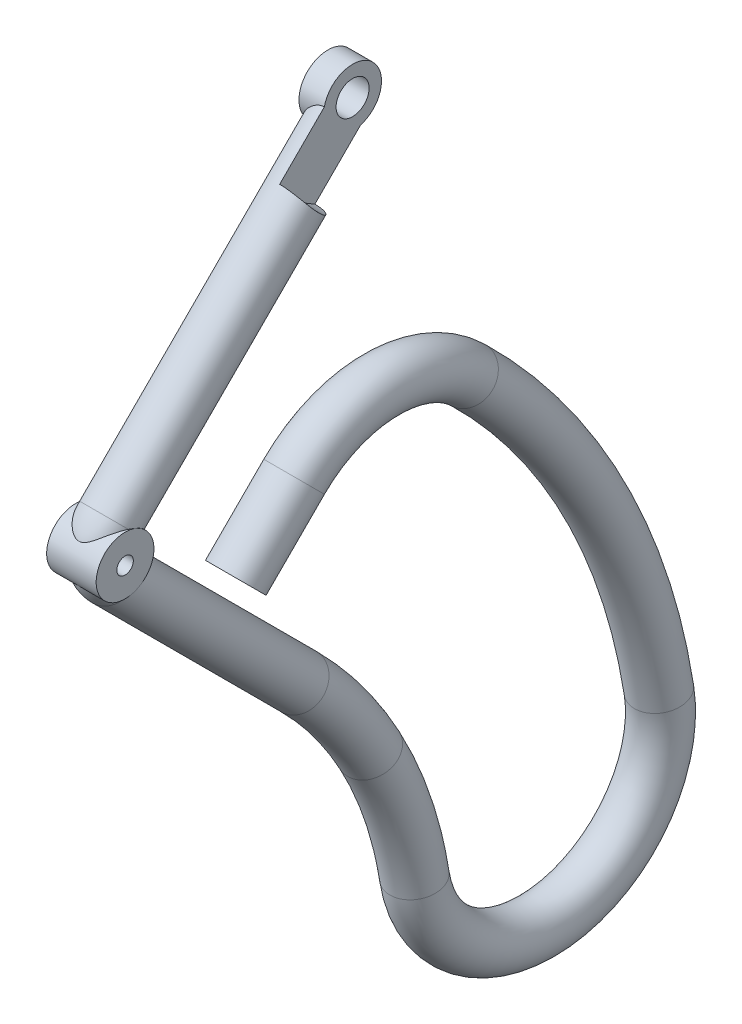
ISO-10303-21;
HEADER;
FILE_DESCRIPTION(('STEP AP214'),'2;1');
FILE_NAME('part.step','',(''),(''),'','','');
FILE_SCHEMA(('AUTOMOTIVE_DESIGN { 1 0 10303 214 1 1 1 1 }'));
ENDSEC;
DATA;
#1=APPLICATION_CONTEXT('core data for automotive mechanical design processes');
#2=APPLICATION_PROTOCOL_DEFINITION('international standard','automotive_design',2000,#1);
#3=PRODUCT_CONTEXT('',#1,'mechanical');
#4=PRODUCT('Part','Part','',(#3));
#5=PRODUCT_RELATED_PRODUCT_CATEGORY('part','',(#4));
#6=PRODUCT_DEFINITION_FORMATION('','',#4);
#7=PRODUCT_DEFINITION_CONTEXT('part definition',#1,'design');
#8=PRODUCT_DEFINITION('design','',#6,#7);
#9=PRODUCT_DEFINITION_SHAPE('','',#8);
#10=(LENGTH_UNIT() NAMED_UNIT(*) SI_UNIT(.MILLI.,.METRE.));
#11=(NAMED_UNIT(*) PLANE_ANGLE_UNIT() SI_UNIT($,.RADIAN.));
#12=(NAMED_UNIT(*) SI_UNIT($,.STERADIAN.) SOLID_ANGLE_UNIT());
#13=UNCERTAINTY_MEASURE_WITH_UNIT(LENGTH_MEASURE(1.E-05),#10,'distance_accuracy_value','');
#14=(GEOMETRIC_REPRESENTATION_CONTEXT(3) GLOBAL_UNCERTAINTY_ASSIGNED_CONTEXT((#13)) GLOBAL_UNIT_ASSIGNED_CONTEXT((#10,
#11,#12)) REPRESENTATION_CONTEXT('',''));
#15=CARTESIAN_POINT('',(0.,0.,0.));
#16=DIRECTION('',(0.,0.,1.));
#17=DIRECTION('',(1.,0.,0.));
#18=AXIS2_PLACEMENT_3D('',#15,#16,#17);
#19=CARTESIAN_POINT('',(0.,-48.6080483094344,32.7136193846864));
#20=DIRECTION('',(-1.,0.,0.));
#21=DIRECTION('',(0.,0.,1.));
#22=AXIS2_PLACEMENT_3D('',#19,#20,#21);
#23=TOROIDAL_SURFACE('',#22,50.,3.);
#24=CARTESIAN_POINT('',(0.,-13.2527092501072,-2.64171967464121));
#25=DIRECTION('',(0.,0.707106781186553,0.707106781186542));
#26=DIRECTION('',(0.,-0.707106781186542,0.707106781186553));
#27=AXIS2_PLACEMENT_3D('',#24,#25,#26);
#28=CIRCLE('',#27,3.);
#29=CARTESIAN_POINT('',(0.,-11.1313889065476,-4.76304001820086));
#30=VERTEX_POINT('',#29);
#31=EDGE_CURVE('E216',#30,#30,#28,.T.);
#32=CARTESIAN_POINT('',(0.,-24.7586816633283,-11.2318890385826));
#33=DIRECTION('',(0.,-0.878910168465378,-0.476987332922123));
#34=DIRECTION('',(0.,0.476987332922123,-0.878910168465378));
#35=AXIS2_PLACEMENT_3D('',#32,#33,#34);
#36=CIRCLE('',#35,3.);
#37=CARTESIAN_POINT('',(0.,-23.3277196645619,-13.8686195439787));
#38=VERTEX_POINT('',#37);
#39=EDGE_CURVE('E11',#38,#38,#36,.T.);
#40=CARTESIAN_POINT('',(0.,-48.6080483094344,32.7136193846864));
#41=DIRECTION('',(-1.,0.,0.));
#42=DIRECTION('',(0.,0.,1.));
#43=AXIS2_PLACEMENT_3D('',#40,#41,#42);
#44=CIRCLE('',#43,53.);
#45=EDGE_CURVE('',#30,#38,#44,.T.);
#46=ORIENTED_EDGE('',*,*,#31,.F.);
#47=ORIENTED_EDGE('',*,*,#39,.F.);
#48=ORIENTED_EDGE('',*,*,#45,.T.);
#49=ORIENTED_EDGE('',*,*,#45,.F.);
#50=EDGE_LOOP('',(#46,#48,#47,#49));
#51=FACE_BOUND('',#50,.T.);
#52=ADVANCED_FACE('F34',(#51),#23,.T.);
#53=CARTESIAN_POINT('',(0.,15.2670221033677,20.221157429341));
#54=DIRECTION('',(0.,0.707106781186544,-0.707106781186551));
#55=DIRECTION('',(0.,0.707106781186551,0.707106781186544));
#56=AXIS2_PLACEMENT_3D('',#53,#54,#55);
#57=CYLINDRICAL_SURFACE('',#56,3.);
#58=CARTESIAN_POINT('',(0.,40.0641375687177,-0.333317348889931));
#59=CARTESIAN_POINT('',(0.0824325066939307,40.0641528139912,-0.33331817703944));
#60=CARTESIAN_POINT('',(0.164858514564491,40.0609967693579,-0.334981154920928));
#61=CARTESIAN_POINT('',(0.329082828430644,40.0484578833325,-0.341635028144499));
#62=CARTESIAN_POINT('',(0.410881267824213,40.0390764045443,-0.346625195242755));
#63=CARTESIAN_POINT('',(0.573072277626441,40.0142329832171,-0.359920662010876));
#64=CARTESIAN_POINT('',(0.653467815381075,39.9987860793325,-0.368217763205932));
#65=CARTESIAN_POINT('',(0.812471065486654,39.9620443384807,-0.388128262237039));
#66=CARTESIAN_POINT('',(0.891078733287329,39.9407493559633,-0.399741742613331));
#67=CARTESIAN_POINT('',(1.12335396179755,39.868503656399,-0.439569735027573));
#68=CARTESIAN_POINT('',(1.273675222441,39.8091605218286,-0.472788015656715));
#69=CARTESIAN_POINT('',(1.56120518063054,39.67104767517,-0.55263171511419));
#70=CARTESIAN_POINT('',(1.69840800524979,39.592269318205,-0.599263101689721));
#71=CARTESIAN_POINT('',(1.96002131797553,39.4163132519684,-0.707499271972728));
#72=CARTESIAN_POINT('',(2.08397783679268,39.3186902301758,-0.769479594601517));
#73=CARTESIAN_POINT('',(2.31150590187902,39.110548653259,-0.907636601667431));
#74=CARTESIAN_POINT('',(2.41507414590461,39.000028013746,-0.98381558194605));
#75=CARTESIAN_POINT('',(2.60076611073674,38.7681264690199,-1.15150990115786));
#76=CARTESIAN_POINT('',(2.6824456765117,38.6465792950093,-1.24328879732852));
#77=CARTESIAN_POINT('',(2.81910245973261,38.399150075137,-1.43994266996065));
#78=CARTESIAN_POINT('',(2.87408666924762,38.2732691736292,-1.54481420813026));
#79=CARTESIAN_POINT('',(2.95424195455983,38.0254861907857,-1.7623351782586));
#80=CARTESIAN_POINT('',(2.98022800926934,37.9035741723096,-1.87467260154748));
#81=CARTESIAN_POINT('',(3.00425133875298,37.6641738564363,-2.10678696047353));
#82=CARTESIAN_POINT('',(3.00229364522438,37.5466847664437,-2.22656255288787));
#83=CARTESIAN_POINT('',(2.97103299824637,37.3231401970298,-2.46614560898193));
#84=CARTESIAN_POINT('',(2.94256749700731,37.2168450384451,-2.58584025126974));
#85=CARTESIAN_POINT('',(2.86049044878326,37.0141885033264,-2.82499677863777));
#86=CARTESIAN_POINT('',(2.80687739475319,36.9178277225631,-2.94445864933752));
#87=CARTESIAN_POINT('',(2.67533484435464,36.7354924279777,-3.18079293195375));
#88=CARTESIAN_POINT('',(2.5970924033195,36.6496725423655,-3.29761001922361));
#89=CARTESIAN_POINT('',(2.4187595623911,36.4908540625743,-3.52300016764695));
#90=CARTESIAN_POINT('',(2.31866413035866,36.417858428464,-3.63157132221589));
#91=CARTESIAN_POINT('',(2.09485030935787,36.2824707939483,-3.84060383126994));
#92=CARTESIAN_POINT('',(1.97036105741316,36.2206052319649,-3.94058186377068));
#93=CARTESIAN_POINT('',(1.70362706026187,36.1111622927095,-4.12330053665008));
#94=CARTESIAN_POINT('',(1.56137718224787,36.0635890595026,-4.20603617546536));
#95=CARTESIAN_POINT('',(1.26141718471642,35.9822617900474,-4.35102324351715));
#96=CARTESIAN_POINT('',(1.10357725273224,35.9486384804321,-4.41307986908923));
#97=CARTESIAN_POINT('',(0.778066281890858,35.8957552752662,-4.51217740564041));
#98=CARTESIAN_POINT('',(0.610411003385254,35.8764729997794,-4.54925728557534));
#99=CARTESIAN_POINT('',(0.367653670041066,35.8590820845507,-4.58286059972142));
#100=CARTESIAN_POINT('',(0.294330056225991,35.8551698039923,-4.59045285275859));
#101=CARTESIAN_POINT('',(0.147350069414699,35.8499613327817,-4.60057881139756));
#102=CARTESIAN_POINT('',(0.0736943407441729,35.8486613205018,-4.60311990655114));
#103=CARTESIAN_POINT('',(0.,35.8486580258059,-4.60311918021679));
#104=B_SPLINE_CURVE_WITH_KNOTS('',3,(#58,#59,#60,#61,#62,#63,#64,#65,#66,#67,#68,#69,#70,#71,
#72,#73,#74,#75,#76,#77,#78,#79,#80,#81,#82,#83,#84,#85,#86,#87,#88,#89,#90,#91,#92,#93,#94,#95,
#96,#97,#98,#99,#100,#101,#102,#103),.UNSPECIFIED.,.F.,.F.,(4,2,2,2,2,2,2,2,2,2,2,2,2,2,2,2,2,2,
2,2,2,2,4),(0.,0.247209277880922,0.494364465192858,0.740910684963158,0.987463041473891,
1.47996169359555,1.97267980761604,2.47890938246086,2.9852208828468,3.50113875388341,
4.01692142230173,4.517811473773,5.01861133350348,5.50410761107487,5.98963298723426,
6.48159505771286,6.9736705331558,7.48499339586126,7.99646437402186,8.51262568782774,
9.02797980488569,9.24925526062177,9.47020676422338),.UNSPECIFIED.);
#105=CARTESIAN_POINT('',(0.,40.0641375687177,-0.333317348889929));
#106=VERTEX_POINT('',#105);
#107=CARTESIAN_POINT('',(0.,35.8486580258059,-4.60311918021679));
#108=VERTEX_POINT('',#107);
#109=EDGE_CURVE('E43',#106,#108,#104,.T.);
#110=ORIENTED_EDGE('',*,*,#109,.F.);
#111=DIRECTION('',(0.,0.707106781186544,-0.707106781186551));
#112=VECTOR('',#111,1.);
#113=CARTESIAN_POINT('',(0.,17.3883424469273,22.3424777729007));
#114=LINE('',#113,#112);
#115=CARTESIAN_POINT('',(0.,45.4789323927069,-5.7481121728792));
#116=VERTEX_POINT('',#115);
#117=EDGE_CURVE('E94',#106,#116,#114,.T.);
#118=ORIENTED_EDGE('',*,*,#117,.T.);
#119=CARTESIAN_POINT('',(0.,45.4789323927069,-5.74811217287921));
#120=CARTESIAN_POINT('',(-0.104793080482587,45.4789100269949,-5.74810195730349));
#121=CARTESIAN_POINT('',(-0.209748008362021,45.4688622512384,-5.74590550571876));
#122=CARTESIAN_POINT('',(-0.416175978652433,45.4303933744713,-5.73800773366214));
#123=CARTESIAN_POINT('',(-0.517636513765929,45.4019123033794,-5.73229497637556));
#124=CARTESIAN_POINT('',(-0.75448913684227,45.3161423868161,-5.71683394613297));
#125=CARTESIAN_POINT('',(-0.887255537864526,45.2518919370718,-5.70638511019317));
#126=CARTESIAN_POINT('',(-1.14188019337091,45.1041108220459,-5.6879459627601));
#127=CARTESIAN_POINT('',(-1.2636994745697,45.0205147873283,-5.67996420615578));
#128=CARTESIAN_POINT('',(-1.46519745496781,44.8645277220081,-5.67167821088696));
#129=CARTESIAN_POINT('',(-1.5473063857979,44.7953010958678,-5.66987355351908));
#130=CARTESIAN_POINT('',(-1.70631886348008,44.6510617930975,-5.67076525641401));
#131=CARTESIAN_POINT('',(-1.78322011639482,44.5760465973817,-5.67346358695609));
#132=CARTESIAN_POINT('',(-1.93165051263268,44.4214306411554,-5.68436167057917));
#133=CARTESIAN_POINT('',(-2.00318652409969,44.3418359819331,-5.69255425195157));
#134=CARTESIAN_POINT('',(-2.14071889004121,44.178863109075,-5.71532948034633));
#135=CARTESIAN_POINT('',(-2.20671472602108,44.0954845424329,-5.72991272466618));
#136=CARTESIAN_POINT('',(-2.36760467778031,43.8787349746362,-5.7764182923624));
#137=CARTESIAN_POINT('',(-2.45827903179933,43.7432336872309,-5.81346994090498));
#138=CARTESIAN_POINT('',(-2.62210510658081,43.4688501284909,-5.90790053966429));
#139=CARTESIAN_POINT('',(-2.6952849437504,43.3299736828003,-5.96524650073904));
#140=CARTESIAN_POINT('',(-2.80960042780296,43.077424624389,-6.09029431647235));
#141=CARTESIAN_POINT('',(-2.85408932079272,42.9635475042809,-6.15448918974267));
#142=CARTESIAN_POINT('',(-2.9262991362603,42.740144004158,-6.29815236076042));
#143=CARTESIAN_POINT('',(-2.95402972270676,42.630615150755,-6.37761182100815));
#144=CARTESIAN_POINT('',(-2.9910915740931,42.4193070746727,-6.55093344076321));
#145=CARTESIAN_POINT('',(-3.00034482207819,42.3175624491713,-6.6448548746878));
#146=CARTESIAN_POINT('',(-2.99963548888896,42.1260056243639,-6.84409205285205));
#147=CARTESIAN_POINT('',(-2.98967400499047,42.0361927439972,-6.94940714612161));
#148=CARTESIAN_POINT('',(-2.95270884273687,41.8766577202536,-7.16025791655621));
#149=CARTESIAN_POINT('',(-2.92690601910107,41.8059864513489,-7.2652948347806));
#150=CARTESIAN_POINT('',(-2.86092800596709,41.6780637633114,-7.47890131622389));
#151=CARTESIAN_POINT('',(-2.8207484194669,41.6208164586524,-7.58747195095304));
#152=CARTESIAN_POINT('',(-2.71267217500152,41.5030512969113,-7.84114972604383));
#153=CARTESIAN_POINT('',(-2.64000759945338,41.4476046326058,-7.98657550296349));
#154=CARTESIAN_POINT('',(-2.47680016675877,41.3581076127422,-8.27409321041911));
#155=CARTESIAN_POINT('',(-2.38621877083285,41.3241040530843,-8.41617720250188));
#156=CARTESIAN_POINT('',(-2.22563538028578,41.2834918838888,-8.64345653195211));
#157=CARTESIAN_POINT('',(-2.15989302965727,41.2714326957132,-8.73078992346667));
#158=CARTESIAN_POINT('',(-2.0229319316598,41.2540543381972,-8.90175408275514));
#159=CARTESIAN_POINT('',(-1.95171357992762,41.2487346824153,-8.98538511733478));
#160=CARTESIAN_POINT('',(-1.80408007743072,41.2439197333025,-9.14816253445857));
#161=CARTESIAN_POINT('',(-1.72766237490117,41.2444273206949,-9.22730667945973));
#162=CARTESIAN_POINT('',(-1.56972172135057,41.2502556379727,-9.38005919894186));
#163=CARTESIAN_POINT('',(-1.48820115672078,41.2555741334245,-9.45367012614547));
#164=CARTESIAN_POINT('',(-1.29899400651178,41.2716012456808,-9.61141372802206));
#165=CARTESIAN_POINT('',(-1.18981033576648,41.2833152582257,-9.69366822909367));
#166=CARTESIAN_POINT('',(-0.96202212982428,41.3093069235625,-9.84340509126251));
#167=CARTESIAN_POINT('',(-0.84343752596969,41.3235792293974,-9.91091762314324));
#168=CARTESIAN_POINT('',(-0.634413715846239,41.3458588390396,-10.0062193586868));
#169=CARTESIAN_POINT('',(-0.546744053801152,41.3544310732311,-10.0398299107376));
#170=CARTESIAN_POINT('',(-0.36708817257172,41.3685267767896,-10.0930565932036));
#171=CARTESIAN_POINT('',(-0.275114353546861,41.3740584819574,-10.1127105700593));
#172=CARTESIAN_POINT('',(-0.087899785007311,41.3803964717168,-10.1351221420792));
#173=CARTESIAN_POINT('',(0.0073645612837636,41.381154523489,-10.1377072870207));
#174=CARTESIAN_POINT('',(0.196622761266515,41.3775284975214,-10.1249927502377));
#175=CARTESIAN_POINT('',(0.29061492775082,41.3731381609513,-10.1096712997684));
#176=CARTESIAN_POINT('',(0.494121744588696,41.3593801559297,-10.0589306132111));
#177=CARTESIAN_POINT('',(0.602639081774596,41.3491465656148,-10.0199041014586));
#178=CARTESIAN_POINT('',(0.812400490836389,41.3269779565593,-9.92578926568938));
#179=CARTESIAN_POINT('',(0.913615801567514,41.3150367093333,-9.87064133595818));
#180=CARTESIAN_POINT('',(1.09670551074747,41.2938601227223,-9.75674279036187));
#181=CARTESIAN_POINT('',(1.17940925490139,41.2844734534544,-9.69932366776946));
#182=CARTESIAN_POINT('',(1.34005922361,41.2680650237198,-9.57780095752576));
#183=CARTESIAN_POINT('',(1.41800209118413,41.2610449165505,-9.5136927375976));
#184=CARTESIAN_POINT('',(1.56951296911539,41.2504480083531,-9.38007601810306));
#185=CARTESIAN_POINT('',(1.64307552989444,41.2468754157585,-9.31056102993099));
#186=CARTESIAN_POINT('',(1.78586094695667,41.2440631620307,-9.16712046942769));
#187=CARTESIAN_POINT('',(1.8550835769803,41.2448237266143,-9.09319466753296));
#188=CARTESIAN_POINT('',(1.99284312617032,41.2516317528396,-8.93742915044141));
#189=CARTESIAN_POINT('',(2.06112758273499,41.2579710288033,-8.8553779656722));
#190=CARTESIAN_POINT('',(2.19246613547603,41.2771721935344,-8.68787617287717));
#191=CARTESIAN_POINT('',(2.25551911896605,41.290035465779,-8.60242484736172));
#192=CARTESIAN_POINT('',(2.37567124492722,41.3230335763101,-8.42911152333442));
#193=CARTESIAN_POINT('',(2.43278652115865,41.3431480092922,-8.34125692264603));
#194=CARTESIAN_POINT('',(2.54050294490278,41.3913715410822,-8.16377450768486));
#195=CARTESIAN_POINT('',(2.59110495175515,41.4194795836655,-8.07414692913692));
#196=CARTESIAN_POINT('',(2.701870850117,41.4960940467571,-7.86148152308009));
#197=CARTESIAN_POINT('',(2.75888177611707,41.5483012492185,-7.73807491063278));
#198=CARTESIAN_POINT('',(2.85640314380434,41.6697520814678,-7.4931261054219));
#199=CARTESIAN_POINT('',(2.89692531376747,41.738983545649,-7.3715826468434));
#200=CARTESIAN_POINT('',(2.95910263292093,41.8948472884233,-7.13355643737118));
#201=CARTESIAN_POINT('',(2.98062365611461,41.9815980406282,-7.01711509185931));
#202=CARTESIAN_POINT('',(3.00246422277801,42.1701318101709,-6.79490233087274));
#203=CARTESIAN_POINT('',(3.00279441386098,42.2719072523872,-6.68912558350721));
#204=CARTESIAN_POINT('',(2.98325432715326,42.4750867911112,-6.50278983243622));
#205=CARTESIAN_POINT('',(2.96555599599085,42.575350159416,-6.42074179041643));
#206=CARTESIAN_POINT('',(2.91424780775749,42.7815654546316,-6.26989923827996));
#207=CARTESIAN_POINT('',(2.88063525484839,42.8875183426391,-6.2011069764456));
#208=CARTESIAN_POINT('',(2.79810829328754,43.1048609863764,-6.07561244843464));
#209=CARTESIAN_POINT('',(2.74879844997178,43.2163201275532,-6.01929474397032));
#210=CARTESIAN_POINT('',(2.63733424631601,43.4389141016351,-5.92071037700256));
#211=CARTESIAN_POINT('',(2.57517573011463,43.550048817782,-5.87844827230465));
#212=CARTESIAN_POINT('',(2.40824377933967,43.8211232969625,-5.79008883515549));
#213=CARTESIAN_POINT('',(2.29712236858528,43.9796280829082,-5.75141065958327));
#214=CARTESIAN_POINT('',(2.11598069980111,44.2089268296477,-5.71063690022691));
#215=CARTESIAN_POINT('',(2.05303255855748,44.2841091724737,-5.69991502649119));
#216=CARTESIAN_POINT('',(1.92257036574,44.430980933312,-5.68356914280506));
#217=CARTESIAN_POINT('',(1.85505811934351,44.5026717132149,-5.67794312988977));
#218=CARTESIAN_POINT('',(1.71430028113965,44.6431498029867,-5.67100855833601));
#219=CARTESIAN_POINT('',(1.64097033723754,44.7118564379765,-5.66978376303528));
#220=CARTESIAN_POINT('',(1.48965715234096,44.843991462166,-5.67103509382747));
#221=CARTESIAN_POINT('',(1.41167187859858,44.9074175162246,-5.67351284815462));
#222=CARTESIAN_POINT('',(1.25113373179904,45.0275027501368,-5.68117219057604));
#223=CARTESIAN_POINT('',(1.16859611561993,45.0841827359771,-5.68634518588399));
#224=CARTESIAN_POINT('',(0.998524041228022,45.1891665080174,-5.69817505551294));
#225=CARTESIAN_POINT('',(0.910995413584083,45.237479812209,-5.70483022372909));
#226=CARTESIAN_POINT('',(0.724504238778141,45.3262550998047,-5.71857811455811));
#227=CARTESIAN_POINT('',(0.625169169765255,45.3659526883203,-5.72566958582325));
#228=CARTESIAN_POINT('',(0.42144612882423,45.428863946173,-5.73759831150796));
#229=CARTESIAN_POINT('',(0.317081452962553,45.4521470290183,-5.74244502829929));
#230=CARTESIAN_POINT('',(0.176455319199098,45.4699687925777,-5.74619958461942));
#231=CARTESIAN_POINT('',(0.141261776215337,45.4733195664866,-5.74691194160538));
#232=CARTESIAN_POINT('',(0.070718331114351,45.4778054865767,-5.74787003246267));
#233=CARTESIAN_POINT('',(0.0353683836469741,45.4789399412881,-5.7481156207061));
#234=CARTESIAN_POINT('',(0.,45.4789323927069,-5.74811217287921));
#235=B_SPLINE_CURVE_WITH_KNOTS('',3,(#119,#120,#121,#122,#123,#124,#125,#126,#127,#128,#129,
#130,#131,#132,#133,#134,#135,#136,#137,#138,#139,#140,#141,#142,#143,#144,#145,#146,#147,#148,
#149,#150,#151,#152,#153,#154,#155,#156,#157,#158,#159,#160,#161,#162,#163,#164,#165,#166,#167,
#168,#169,#170,#171,#172,#173,#174,#175,#176,#177,#178,#179,#180,#181,#182,#183,#184,#185,#186,
#187,#188,#189,#190,#191,#192,#193,#194,#195,#196,#197,#198,#199,#200,#201,#202,#203,#204,#205,
#206,#207,#208,#209,#210,#211,#212,#213,#214,#215,#216,#217,#218,#219,#220,#221,#222,#223,#224,
#225,#226,#227,#228,#229,#230,#231,#232,#233,#234),.UNSPECIFIED.,.T.,.F.,(4,2,2,2,2,2,2,2,2,2,2,
2,2,2,2,2,2,2,2,2,2,2,2,2,2,2,2,2,2,2,2,2,2,2,2,2,2,2,2,2,2,2,2,2,2,2,2,2,2,2,2,2,2,2,2,2,2,4),
(0.,0.314220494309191,0.629468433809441,1.07057906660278,1.51320257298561,1.83507933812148,
2.15709697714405,2.47869509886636,2.80032328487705,3.29994591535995,3.7987600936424,
4.21129421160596,4.62359020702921,5.03762339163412,5.45163293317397,5.83758157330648,
6.22364835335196,6.7361764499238,7.2498192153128,7.5793715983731,7.90890019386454,
8.23859170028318,8.56813015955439,8.97888729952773,9.38879574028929,9.67074654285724,
9.95192982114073,10.2359496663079,10.5203151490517,10.8657031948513,11.2123847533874,
11.5153443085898,11.8185150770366,12.1220554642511,12.4256116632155,12.7460580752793,
13.0665724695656,13.3861918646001,13.7057690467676,14.1408355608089,14.5755920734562,
15.0133934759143,15.450974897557,15.8414247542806,16.2319407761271,16.63319753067,
17.0345842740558,17.6233432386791,17.919053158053,18.2146467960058,18.5158371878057,
18.8171600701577,19.1175281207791,19.4175521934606,19.7381254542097,20.0573348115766,
20.1633533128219,20.2694048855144),.UNSPECIFIED.);
#236=CARTESIAN_POINT('',(-3.,42.2271177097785,-6.73893817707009));
#237=VERTEX_POINT('',#236);
#238=EDGE_CURVE('E58',#116,#237,#235,.T.);
#239=ORIENTED_EDGE('',*,*,#238,.T.);
#240=CARTESIAN_POINT('',(0.,41.3803245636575,-10.1347857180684));
#241=VERTEX_POINT('',#240);
#242=EDGE_CURVE('E97',#237,#241,#235,.T.);
#243=ORIENTED_EDGE('',*,*,#242,.T.);
#244=DIRECTION('',(0.,0.707106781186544,-0.707106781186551));
#245=VECTOR('',#244,1.);
#246=CARTESIAN_POINT('',(0.,13.145701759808,18.0998370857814));
#247=LINE('',#246,#245);
#248=EDGE_CURVE('E50',#241,#108,#247,.F.);
#249=ORIENTED_EDGE('',*,*,#248,.T.);
#250=EDGE_LOOP('',(#110,#118,#239,#243,#249));
#251=FACE_BOUND('',#250,.T.);
#252=CARTESIAN_POINT('',(0.,15.2670221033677,20.221157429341));
#253=DIRECTION('',(0.,0.707106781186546,-0.707106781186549));
#254=DIRECTION('',(0.,0.707106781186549,0.707106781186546));
#255=AXIS2_PLACEMENT_3D('',#252,#253,#254);
#256=CIRCLE('',#255,3.);
#257=CARTESIAN_POINT('',(-2.86473837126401,15.8968133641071,20.8509486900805));
#258=VERTEX_POINT('',#257);
#259=CARTESIAN_POINT('',(2.86473837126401,15.8968133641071,20.8509486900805));
#260=VERTEX_POINT('',#259);
#261=EDGE_CURVE('E179',#258,#260,#256,.T.);
#262=ORIENTED_EDGE('',*,*,#261,.T.);
#263=CARTESIAN_POINT('',(2.86473837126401,15.8968133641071,20.8509486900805));
#264=CARTESIAN_POINT('',(2.88233656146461,15.8860222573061,20.7817059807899));
#265=CARTESIAN_POINT('',(2.89856788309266,15.873085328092,20.7124278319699));
#266=CARTESIAN_POINT('',(2.92787516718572,15.8428676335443,20.5740885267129));
#267=CARTESIAN_POINT('',(2.94094830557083,15.8255830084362,20.50502761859));
#268=CARTESIAN_POINT('',(2.96353693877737,15.7865465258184,20.3672165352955));
#269=CARTESIAN_POINT('',(2.97303565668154,15.7647743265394,20.2984692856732));
#270=CARTESIAN_POINT('',(2.98796725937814,15.7168796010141,20.1620973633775));
#271=CARTESIAN_POINT('',(2.99340127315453,15.6907582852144,20.0944723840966));
#272=CARTESIAN_POINT('',(3.00303113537,15.605672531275,19.893201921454));
#273=CARTESIAN_POINT('',(3.00043936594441,15.5401728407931,19.7618243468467));
#274=CARTESIAN_POINT('',(2.97482088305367,15.3944151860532,19.5101867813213));
#275=CARTESIAN_POINT('',(2.9518539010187,15.3142009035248,19.3898954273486));
#276=CARTESIAN_POINT('',(2.8878585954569,15.1503761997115,19.1735994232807));
#277=CARTESIAN_POINT('',(2.84856950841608,15.0676637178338,19.0763932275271));
#278=CARTESIAN_POINT('',(2.7532384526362,14.8969233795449,18.895724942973));
#279=CARTESIAN_POINT('',(2.69717915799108,14.8088901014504,18.812277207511));
#280=CARTESIAN_POINT('',(2.56917709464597,14.6304679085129,18.6588919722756));
#281=CARTESIAN_POINT('',(2.49706234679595,14.5400636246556,18.5891174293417));
#282=CARTESIAN_POINT('',(2.33922636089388,14.3615109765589,18.4636531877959));
#283=CARTESIAN_POINT('',(2.25350390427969,14.2733628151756,18.4079647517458));
#284=CARTESIAN_POINT('',(2.05663829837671,14.0898842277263,18.3020883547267));
#285=CARTESIAN_POINT('',(1.94361061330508,13.9954099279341,18.2539206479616));
#286=CARTESIAN_POINT('',(1.70401738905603,13.8179364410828,18.171910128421));
#287=CARTESIAN_POINT('',(1.5774343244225,13.7349524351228,18.1380861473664));
#288=CARTESIAN_POINT('',(1.29450280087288,13.5747448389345,18.0784241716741));
#289=CARTESIAN_POINT('',(1.1364463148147,13.4998321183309,18.054293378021));
#290=CARTESIAN_POINT('',(0.890912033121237,13.4081318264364,18.0269543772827));
#291=CARTESIAN_POINT('',(0.807657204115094,13.3810095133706,18.0193175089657));
#292=CARTESIAN_POINT('',(0.638861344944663,13.3344033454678,18.0066321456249));
#293=CARTESIAN_POINT('',(0.553321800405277,13.3149146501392,18.001582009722));
#294=CARTESIAN_POINT('',(0.386459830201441,13.2852537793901,17.994054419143));
#295=CARTESIAN_POINT('',(0.305239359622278,13.2745444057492,17.9914271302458));
#296=CARTESIAN_POINT('',(0.142151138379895,13.2606809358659,17.9880469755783));
#297=CARTESIAN_POINT('',(0.0602837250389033,13.2575231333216,17.9872931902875));
#298=CARTESIAN_POINT('',(-0.103384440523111,13.2588644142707,17.9876158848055));
#299=CARTESIAN_POINT('',(-0.185185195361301,13.2633631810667,17.9886922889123));
#300=CARTESIAN_POINT('',(-0.347956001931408,13.2798518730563,17.9927346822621));
#301=CARTESIAN_POINT('',(-0.428926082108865,13.2918415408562,17.9957006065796));
#302=CARTESIAN_POINT('',(-0.651550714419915,13.335022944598,18.0067576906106));
#303=CARTESIAN_POINT('',(-0.791669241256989,13.3738943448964,18.0170389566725));
#304=CARTESIAN_POINT('',(-1.06416746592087,13.4708076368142,18.0454335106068));
#305=CARTESIAN_POINT('',(-1.19654313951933,13.5288593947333,18.0635508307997));
#306=CARTESIAN_POINT('',(-1.46517978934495,13.6672905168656,18.1119946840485));
#307=CARTESIAN_POINT('',(-1.60036178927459,13.7493857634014,18.143413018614));
#308=CARTESIAN_POINT('',(-1.85677811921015,13.9273472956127,18.2210585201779));
#309=CARTESIAN_POINT('',(-1.97800066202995,14.0232250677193,18.2672980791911));
#310=CARTESIAN_POINT('',(-2.21540040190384,14.2339148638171,18.3830478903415));
#311=CARTESIAN_POINT('',(-2.32988978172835,14.3496616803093,18.4544088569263));
#312=CARTESIAN_POINT('',(-2.48367366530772,14.5257055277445,18.5795902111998));
#313=CARTESIAN_POINT('',(-2.53194568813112,14.5847944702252,18.6243439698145));
#314=CARTESIAN_POINT('',(-2.62205294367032,14.702836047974,18.7201244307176));
#315=CARTESIAN_POINT('',(-2.66388958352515,14.7617887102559,18.7711497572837));
#316=CARTESIAN_POINT('',(-2.736102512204,14.8716048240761,18.8731156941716));
#317=CARTESIAN_POINT('',(-2.76724733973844,14.9226064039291,18.923365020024));
#318=CARTESIAN_POINT('',(-2.82382494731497,15.0228568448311,19.0285989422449));
#319=CARTESIAN_POINT('',(-2.84925879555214,15.0721060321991,19.0835826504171));
#320=CARTESIAN_POINT('',(-2.89418631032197,15.1680195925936,19.1979254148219));
#321=CARTESIAN_POINT('',(-2.9136876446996,15.2146872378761,19.2572786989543));
#322=CARTESIAN_POINT('',(-2.94672082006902,15.3047668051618,19.3799490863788));
#323=CARTESIAN_POINT('',(-2.96025342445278,15.3481791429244,19.4432656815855));
#324=CARTESIAN_POINT('',(-2.98884400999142,15.4603005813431,19.6191237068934));
#325=CARTESIAN_POINT('',(-2.99829129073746,15.525348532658,19.7349896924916));
#326=CARTESIAN_POINT('',(-3.00128790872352,15.6419033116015,19.9736229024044));
#327=CARTESIAN_POINT('',(-2.99481444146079,15.6933905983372,20.0963997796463));
#328=CARTESIAN_POINT('',(-2.9704355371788,15.7742834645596,20.3246385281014));
#329=CARTESIAN_POINT('',(-2.954629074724,15.8059440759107,20.4295516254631));
#330=CARTESIAN_POINT('',(-2.91516493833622,15.8589885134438,20.6400091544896));
#331=CARTESIAN_POINT('',(-2.89154195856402,15.8804167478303,20.7455488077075));
#332=CARTESIAN_POINT('',(-2.86473837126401,15.8968133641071,20.8509486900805));
#333=B_SPLINE_CURVE_WITH_KNOTS('',3,(#263,#264,#265,#266,#267,#268,#269,#270,#271,#272,#273,
#274,#275,#276,#277,#278,#279,#280,#281,#282,#283,#284,#285,#286,#287,#288,#289,#290,#291,#292,
#293,#294,#295,#296,#297,#298,#299,#300,#301,#302,#303,#304,#305,#306,#307,#308,#309,#310,#311,
#312,#313,#314,#315,#316,#317,#318,#319,#320,#321,#322,#323,#324,#325,#326,#327,#328,#329,#330,
#331,#332),.UNSPECIFIED.,.F.,.F.,(4,2,2,2,2,2,2,2,2,2,2,2,2,2,2,2,2,2,2,2,2,2,2,2,2,2,2,2,2,2,2,
2,2,2,4),(0.,0.216749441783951,0.433691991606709,0.651640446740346,0.869528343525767,
1.30737299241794,1.74393829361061,2.14263995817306,2.54175496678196,2.94537053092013,
3.34902225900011,3.81216405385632,4.2759120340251,4.80260820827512,5.06596719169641,
5.32915890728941,5.57469808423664,5.82011672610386,6.06552521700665,6.31092527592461,
6.74625957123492,7.18181815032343,7.6636079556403,8.14580164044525,8.67573624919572,
8.94073627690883,9.20567827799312,9.43956154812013,9.67340103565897,9.90693698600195,
10.1404430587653,10.5380385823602,10.9362039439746,11.2676034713,11.5975513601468),.UNSPECIFIED.);
#334=CARTESIAN_POINT('',(3.,15.5999611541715,19.8882183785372));
#335=VERTEX_POINT('',#334);
#336=EDGE_CURVE('E240',#260,#335,#333,.T.);
#337=ORIENTED_EDGE('',*,*,#336,.T.);
#338=CARTESIAN_POINT('',(-3.,15.5999611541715,19.8882183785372));
#339=VERTEX_POINT('',#338);
#340=EDGE_CURVE('E239',#335,#339,#333,.T.);
#341=ORIENTED_EDGE('',*,*,#340,.T.);
#342=EDGE_CURVE('E162',#339,#258,#333,.T.);
#343=ORIENTED_EDGE('',*,*,#342,.T.);
#344=EDGE_LOOP('',(#262,#337,#341,#343));
#345=FACE_BOUND('',#344,.T.);
#346=ADVANCED_FACE('F92',(#251,#345),#57,.T.);
#347=CARTESIAN_POINT('',(3.,44.7447971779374,-9.1702526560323));
#348=DIRECTION('',(-1.,0.,0.));
#349=DIRECTION('',(0.,0.,1.));
#350=AXIS2_PLACEMENT_3D('',#347,#348,#349);
#351=CYLINDRICAL_SURFACE('',#350,3.5);
#352=CARTESIAN_POINT('',(0.,44.7447971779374,-9.1702526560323));
#353=DIRECTION('',(1.,0.,0.));
#354=DIRECTION('',(0.,0.,-1.));
#355=AXIS2_PLACEMENT_3D('',#352,#353,#354);
#356=CIRCLE('',#355,3.5);
#357=EDGE_CURVE('E101',#241,#116,#356,.T.);
#358=ORIENTED_EDGE('',*,*,#357,.F.);
#359=ORIENTED_EDGE('',*,*,#242,.F.);
#360=CARTESIAN_POINT('',(-3.,44.7447971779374,-9.1702526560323));
#361=DIRECTION('',(1.,0.,0.));
#362=DIRECTION('',(0.,0.,-1.));
#363=AXIS2_PLACEMENT_3D('',#360,#361,#362);
#364=CIRCLE('',#363,3.5);
#365=EDGE_CURVE('E114',#237,#237,#364,.T.);
#366=ORIENTED_EDGE('',*,*,#365,.T.);
#367=ORIENTED_EDGE('',*,*,#238,.F.);
#368=EDGE_LOOP('',(#358,#359,#366,#367));
#369=FACE_BOUND('',#368,.T.);
#370=ADVANCED_FACE('F212',(#369),#351,.T.);
#371=CARTESIAN_POINT('',(-3.,44.7447971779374,-9.1702526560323));
#372=DIRECTION('',(1.,0.,0.));
#373=DIRECTION('',(0.,0.,-1.));
#374=AXIS2_PLACEMENT_3D('',#371,#372,#373);
#375=CYLINDRICAL_SURFACE('',#374,2.);
#376=CARTESIAN_POINT('',(-3.,44.7447971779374,-9.1702526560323));
#377=DIRECTION('',(1.,0.,0.));
#378=DIRECTION('',(0.,0.,-1.));
#379=AXIS2_PLACEMENT_3D('',#376,#377,#378);
#380=CIRCLE('',#379,2.);
#381=CARTESIAN_POINT('',(-3.,44.7447971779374,-11.1702526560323));
#382=VERTEX_POINT('',#381);
#383=EDGE_CURVE('E111',#382,#382,#380,.T.);
#384=ORIENTED_EDGE('',*,*,#383,.F.);
#385=EDGE_LOOP('',(#384));
#386=FACE_BOUND('',#385,.T.);
#387=CARTESIAN_POINT('',(0.,44.7447971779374,-9.1702526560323));
#388=DIRECTION('',(1.,0.,0.));
#389=DIRECTION('',(0.,0.,-1.));
#390=AXIS2_PLACEMENT_3D('',#387,#388,#389);
#391=CIRCLE('',#390,2.);
#392=CARTESIAN_POINT('',(0.,44.7447971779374,-11.1702526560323));
#393=VERTEX_POINT('',#392);
#394=EDGE_CURVE('E104',#393,#393,#391,.F.);
#395=ORIENTED_EDGE('',*,*,#394,.F.);
#396=EDGE_LOOP('',(#395));
#397=FACE_BOUND('',#396,.T.);
#398=ADVANCED_FACE('F185',(#386,#397),#375,.F.);
#399=CARTESIAN_POINT('',(0.,9.61016785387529,20.2211574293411));
#400=DIRECTION('',(0.,-0.70710678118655,-0.707106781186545));
#401=DIRECTION('',(0.,0.707106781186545,-0.70710678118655));
#402=AXIS2_PLACEMENT_3D('',#399,#400,#401);
#403=CYLINDRICAL_SURFACE('',#402,3.);
#404=ORIENTED_EDGE('',*,*,#31,.T.);
#405=EDGE_LOOP('',(#404));
#406=FACE_BOUND('',#405,.T.);
#407=CARTESIAN_POINT('',(2.86473837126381,8.98037659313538,20.850948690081));
#408=CARTESIAN_POINT('',(2.88233656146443,8.99116769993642,20.7817059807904));
#409=CARTESIAN_POINT('',(2.89856788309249,9.00410462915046,20.7124278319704));
#410=CARTESIAN_POINT('',(2.92787516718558,9.03432232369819,20.5740885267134));
#411=CARTESIAN_POINT('',(2.94094830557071,9.05160694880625,20.5050276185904));
#412=CARTESIAN_POINT('',(2.96353693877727,9.09064343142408,20.367216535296));
#413=CARTESIAN_POINT('',(2.97303565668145,9.11241563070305,20.2984692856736));
#414=CARTESIAN_POINT('',(2.98796725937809,9.16031035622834,20.1620973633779));
#415=CARTESIAN_POINT('',(2.99340127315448,9.18643167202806,20.094472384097));
#416=CARTESIAN_POINT('',(3.00303113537,9.27151742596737,19.8932019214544));
#417=CARTESIAN_POINT('',(3.00043936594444,9.33701711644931,19.7618243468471));
#418=CARTESIAN_POINT('',(2.97482088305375,9.48277477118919,19.5101867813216));
#419=CARTESIAN_POINT('',(2.9518539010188,9.56298905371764,19.3898954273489));
#420=CARTESIAN_POINT('',(2.88785859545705,9.72681375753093,19.1735994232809));
#421=CARTESIAN_POINT('',(2.84856950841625,9.80952623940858,19.0763932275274));
#422=CARTESIAN_POINT('',(2.75323845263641,9.98026657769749,18.8957249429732));
#423=CARTESIAN_POINT('',(2.69717915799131,10.068299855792,18.8122772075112));
#424=CARTESIAN_POINT('',(2.56917709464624,10.2467220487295,18.6588919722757));
#425=CARTESIAN_POINT('',(2.49706234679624,10.3371263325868,18.5891174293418));
#426=CARTESIAN_POINT('',(2.33922636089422,10.5156789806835,18.463653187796));
#427=CARTESIAN_POINT('',(2.25350390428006,10.6038271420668,18.4079647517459));
#428=CARTESIAN_POINT('',(2.05663829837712,10.7873057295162,18.3020883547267));
#429=CARTESIAN_POINT('',(1.94361061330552,10.8817800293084,18.2539206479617));
#430=CARTESIAN_POINT('',(1.70401738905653,11.0592535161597,18.1719101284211));
#431=CARTESIAN_POINT('',(1.57743432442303,11.1422375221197,18.1380861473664));
#432=CARTESIAN_POINT('',(1.29450280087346,11.302445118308,18.0784241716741));
#433=CARTESIAN_POINT('',(1.1364463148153,11.3773578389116,18.054293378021));
#434=CARTESIAN_POINT('',(0.890912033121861,11.4690581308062,18.0269543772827));
#435=CARTESIAN_POINT('',(0.807657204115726,11.496180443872,18.0193175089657));
#436=CARTESIAN_POINT('',(0.638861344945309,11.5427866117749,18.0066321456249));
#437=CARTESIAN_POINT('',(0.55332180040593,11.5622753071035,18.001582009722));
#438=CARTESIAN_POINT('',(0.386459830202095,11.5919361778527,17.994054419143));
#439=CARTESIAN_POINT('',(0.305239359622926,11.6026455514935,17.9914271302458));
#440=CARTESIAN_POINT('',(0.14215113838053,11.6165090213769,17.9880469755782));
#441=CARTESIAN_POINT('',(0.0602837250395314,11.6196668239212,17.9872931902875));
#442=CARTESIAN_POINT('',(-0.103384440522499,11.6183255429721,17.9876158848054));
#443=CARTESIAN_POINT('',(-0.185185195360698,11.6138267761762,17.9886922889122));
#444=CARTESIAN_POINT('',(-0.347956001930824,11.5973380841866,17.992734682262));
#445=CARTESIAN_POINT('',(-0.428926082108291,11.5853484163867,17.9957006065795));
#446=CARTESIAN_POINT('',(-0.651550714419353,11.542167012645,18.0067576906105));
#447=CARTESIAN_POINT('',(-0.79166924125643,11.5032956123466,18.0170389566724));
#448=CARTESIAN_POINT('',(-1.06416746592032,11.4063823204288,18.0454335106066));
#449=CARTESIAN_POINT('',(-1.19654313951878,11.3483305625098,18.0635508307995));
#450=CARTESIAN_POINT('',(-1.4651797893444,11.2098994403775,18.1119946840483));
#451=CARTESIAN_POINT('',(-1.60036178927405,11.1278041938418,18.1434130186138));
#452=CARTESIAN_POINT('',(-1.85677811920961,10.9498426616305,18.2210585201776));
#453=CARTESIAN_POINT('',(-1.97800066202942,10.8539648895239,18.2672980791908));
#454=CARTESIAN_POINT('',(-2.21540040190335,10.6432750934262,18.3830478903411));
#455=CARTESIAN_POINT('',(-2.32988978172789,10.527528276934,18.4544088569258));
#456=CARTESIAN_POINT('',(-2.48367366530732,10.3514844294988,18.5795902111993));
#457=CARTESIAN_POINT('',(-2.53194568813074,10.292395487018,18.624343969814));
#458=CARTESIAN_POINT('',(-2.62205294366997,10.1743539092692,18.720124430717));
#459=CARTESIAN_POINT('',(-2.66388958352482,10.1154012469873,18.7711497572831));
#460=CARTESIAN_POINT('',(-2.73610251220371,10.0055851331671,18.873115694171));
#461=CARTESIAN_POINT('',(-2.76724733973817,9.95458355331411,18.9233650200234));
#462=CARTESIAN_POINT('',(-2.82382494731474,9.85433311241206,19.0285989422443));
#463=CARTESIAN_POINT('',(-2.84925879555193,9.80508392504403,19.0835826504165));
#464=CARTESIAN_POINT('',(-2.89418631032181,9.70917036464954,19.1979254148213));
#465=CARTESIAN_POINT('',(-2.91368764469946,9.662502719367,19.2572786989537));
#466=CARTESIAN_POINT('',(-2.94672082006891,9.57242315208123,19.3799490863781));
#467=CARTESIAN_POINT('',(-2.96025342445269,9.52901081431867,19.4432656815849));
#468=CARTESIAN_POINT('',(-2.98884400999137,9.41688937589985,19.6191237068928));
#469=CARTESIAN_POINT('',(-2.99829129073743,9.351841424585,19.734989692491));
#470=CARTESIAN_POINT('',(-3.00128790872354,9.23528664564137,19.9736229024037));
#471=CARTESIAN_POINT('',(-2.99481444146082,9.18379935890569,20.0963997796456));
#472=CARTESIAN_POINT('',(-2.97043553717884,9.1029064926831,20.3246385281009));
#473=CARTESIAN_POINT('',(-2.95462907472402,9.07124588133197,20.4295516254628));
#474=CARTESIAN_POINT('',(-2.91516493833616,9.01820144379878,20.6400091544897));
#475=CARTESIAN_POINT('',(-2.89154195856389,8.99677320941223,20.7455488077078));
#476=CARTESIAN_POINT('',(-2.86473837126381,8.98037659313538,20.850948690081));
#477=B_SPLINE_CURVE_WITH_KNOTS('',3,(#407,#408,#409,#410,#411,#412,#413,#414,#415,#416,#417,
#418,#419,#420,#421,#422,#423,#424,#425,#426,#427,#428,#429,#430,#431,#432,#433,#434,#435,#436,
#437,#438,#439,#440,#441,#442,#443,#444,#445,#446,#447,#448,#449,#450,#451,#452,#453,#454,#455,
#456,#457,#458,#459,#460,#461,#462,#463,#464,#465,#466,#467,#468,#469,#470,#471,#472,#473,#474,
#475,#476),.UNSPECIFIED.,.F.,.F.,(4,2,2,2,2,2,2,2,2,2,2,2,2,2,2,2,2,2,2,2,2,2,2,2,2,2,2,2,2,2,2,
2,2,2,4),(0.,0.216749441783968,0.433691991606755,0.651640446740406,0.869528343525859,
1.30737299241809,1.7439382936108,2.14263995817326,2.54175496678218,2.94537053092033,
3.34902225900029,3.81216405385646,4.2759120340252,4.80260820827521,5.0659671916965,
5.3291589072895,5.57469808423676,5.820116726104,6.06552521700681,6.3109252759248,
6.74625957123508,7.18181815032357,7.66360795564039,8.14580164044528,8.67573624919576,
8.94073627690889,9.20567827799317,9.43956154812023,9.67340103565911,9.90693698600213,
10.1404430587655,10.5380385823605,10.9362039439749,11.2676034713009,11.5975513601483),.UNSPECIFIED.);
#478=CARTESIAN_POINT('',(2.86473837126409,8.98037659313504,20.8509486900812));
#479=VERTEX_POINT('',#478);
#480=CARTESIAN_POINT('',(3.00000000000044,9.27722880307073,19.8882183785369));
#481=VERTEX_POINT('',#480);
#482=EDGE_CURVE('E178',#479,#481,#477,.T.);
#483=ORIENTED_EDGE('',*,*,#482,.F.);
#484=CARTESIAN_POINT('',(0.,9.61016785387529,20.2211574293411));
#485=DIRECTION('',(0.,0.707106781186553,0.707106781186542));
#486=DIRECTION('',(0.,-0.707106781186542,0.707106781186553));
#487=AXIS2_PLACEMENT_3D('',#484,#485,#486);
#488=CIRCLE('',#487,3.);
#489=CARTESIAN_POINT('',(-2.86473837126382,8.98037659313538,20.850948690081));
#490=VERTEX_POINT('',#489);
#491=EDGE_CURVE('E227',#490,#479,#488,.T.);
#492=ORIENTED_EDGE('',*,*,#491,.F.);
#493=CARTESIAN_POINT('',(-3.,9.27722880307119,19.888218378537));
#494=VERTEX_POINT('',#493);
#495=EDGE_CURVE('E170',#494,#490,#477,.T.);
#496=ORIENTED_EDGE('',*,*,#495,.F.);
#497=EDGE_CURVE('E177',#481,#494,#477,.T.);
#498=ORIENTED_EDGE('',*,*,#497,.F.);
#499=EDGE_LOOP('',(#483,#492,#496,#498));
#500=FACE_BOUND('',#499,.T.);
#501=ADVANCED_FACE('F181',(#406,#500),#403,.T.);
#502=CARTESIAN_POINT('',(0.,12.4385949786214,17.3927303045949));
#503=DIRECTION('',(1.,0.,0.));
#504=DIRECTION('',(0.,0.,-1.));
#505=AXIS2_PLACEMENT_3D('',#502,#503,#504);
#506=TOROIDAL_SURFACE('',#505,4.,3.);
#507=CARTESIAN_POINT('',(-0.483805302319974,11.5911247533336,17.9942888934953));
#508=CARTESIAN_POINT('',(-0.632828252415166,11.5657514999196,18.0006163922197));
#509=CARTESIAN_POINT('',(-0.779837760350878,11.5289644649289,18.0100560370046));
#510=CARTESIAN_POINT('',(-1.06675200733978,11.4353789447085,18.0366469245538));
#511=CARTESIAN_POINT('',(-1.20664354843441,11.3785447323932,18.0538119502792));
#512=CARTESIAN_POINT('',(-1.49284226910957,11.2397224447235,18.1009583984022));
#513=CARTESIAN_POINT('',(-1.63789166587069,11.1555287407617,18.1322348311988));
#514=CARTESIAN_POINT('',(-1.84289143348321,11.016401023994,18.1917172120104));
#515=CARTESIAN_POINT('',(-1.90915173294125,10.967864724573,18.2136500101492));
#516=CARTESIAN_POINT('',(-2.0369981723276,10.8671617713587,18.2622441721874));
#517=CARTESIAN_POINT('',(-2.09858676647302,10.8149970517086,18.2889030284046));
#518=CARTESIAN_POINT('',(-2.21576082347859,10.7085434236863,18.3470239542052));
#519=CARTESIAN_POINT('',(-2.27141769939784,10.6542940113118,18.3784142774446));
#520=CARTESIAN_POINT('',(-2.37719503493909,10.5438934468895,18.4466178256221));
#521=CARTESIAN_POINT('',(-2.42731843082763,10.4877433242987,18.4834281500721));
#522=CARTESIAN_POINT('',(-2.5216145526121,10.3745098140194,18.5627156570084));
#523=CARTESIAN_POINT('',(-2.56579093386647,10.317427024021,18.6051893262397));
#524=CARTESIAN_POINT('',(-2.64788255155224,10.20336326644,18.6958739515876));
#525=CARTESIAN_POINT('',(-2.68579882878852,10.1463822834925,18.7440839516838));
#526=CARTESIAN_POINT('',(-2.78043773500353,9.99241415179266,18.8834626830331));
#527=CARTESIAN_POINT('',(-2.83074899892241,9.89651022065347,18.9803493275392));
#528=CARTESIAN_POINT('',(-2.91161290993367,9.71354108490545,19.1893689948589));
#529=CARTESIAN_POINT('',(-2.94217053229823,9.62647365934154,19.3014981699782));
#530=CARTESIAN_POINT('',(-2.98300940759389,9.47079045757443,19.5300388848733));
#531=CARTESIAN_POINT('',(-2.99450993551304,9.40133013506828,19.6456626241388));
#532=CARTESIAN_POINT('',(-3.00238581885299,9.27610150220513,19.8845378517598));
#533=CARTESIAN_POINT('',(-2.9987601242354,9.22033414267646,20.0077898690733));
#534=CARTESIAN_POINT('',(-2.9774832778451,9.12146608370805,20.2647547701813));
#535=CARTESIAN_POINT('',(-2.95918281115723,9.07908145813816,20.398687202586));
#536=CARTESIAN_POINT('',(-2.90961883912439,9.01100245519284,20.6683496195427));
#537=CARTESIAN_POINT('',(-2.87835000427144,8.98531495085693,20.8040803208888));
#538=CARTESIAN_POINT('',(-2.8001550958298,8.94809073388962,21.0906896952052));
#539=CARTESIAN_POINT('',(-2.75180624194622,8.93860757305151,21.2414439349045));
#540=CARTESIAN_POINT('',(-2.64303286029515,8.93858239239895,21.5384652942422));
#541=CARTESIAN_POINT('',(-2.58260422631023,8.9480468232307,21.6847308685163));
#542=CARTESIAN_POINT('',(-2.440881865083,8.98682376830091,21.9926006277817));
#543=CARTESIAN_POINT('',(-2.35780234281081,9.01901454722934,22.1530159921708));
#544=CARTESIAN_POINT('',(-2.17888631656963,9.10274324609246,22.4614191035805));
#545=CARTESIAN_POINT('',(-2.08303205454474,9.15430828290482,22.6093890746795));
#546=CARTESIAN_POINT('',(-1.92152902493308,9.2479358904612,22.8315349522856));
#547=CARTESIAN_POINT('',(-1.85988824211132,9.28503774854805,22.9108167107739));
#548=CARTESIAN_POINT('',(-1.73226526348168,9.3633977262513,23.0636138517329));
#549=CARTESIAN_POINT('',(-1.66628410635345,9.40465485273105,23.137130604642));
#550=CARTESIAN_POINT('',(-1.52972987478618,9.49007048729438,23.2777187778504));
#551=CARTESIAN_POINT('',(-1.45916318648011,9.53422496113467,23.3447988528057));
#552=CARTESIAN_POINT('',(-1.31277670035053,9.62390603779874,23.4718581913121));
#553=CARTESIAN_POINT('',(-1.23696085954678,9.66943159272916,23.5318427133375));
#554=CARTESIAN_POINT('',(-1.08611406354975,9.75564202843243,23.6387039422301));
#555=CARTESIAN_POINT('',(-1.01161705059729,9.79639628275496,23.686272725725));
#556=CARTESIAN_POINT('',(-0.856414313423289,9.8747297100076,23.7734163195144));
#557=CARTESIAN_POINT('',(-0.775710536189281,9.91230987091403,23.8129936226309));
#558=CARTESIAN_POINT('',(-0.620085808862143,9.97521578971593,23.8767946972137));
#559=CARTESIAN_POINT('',(-0.546171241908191,10.0015368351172,23.9024414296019));
#560=CARTESIAN_POINT('',(-0.393392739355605,10.0457623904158,23.9446051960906));
#561=CARTESIAN_POINT('',(-0.314542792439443,10.0636895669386,23.961146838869));
#562=CARTESIAN_POINT('',(-0.168861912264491,10.0854706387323,23.9810814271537));
#563=CARTESIAN_POINT('',(-0.102607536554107,10.0913567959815,23.9863806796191));
#564=CARTESIAN_POINT('',(0.0302660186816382,10.094456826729,23.9891814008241));
#565=CARTESIAN_POINT('',(0.096885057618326,10.091673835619,23.9866856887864));
#566=CARTESIAN_POINT('',(0.228221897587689,10.0779487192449,23.9742098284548));
#567=CARTESIAN_POINT('',(0.292946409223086,10.0670403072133,23.9642606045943));
#568=CARTESIAN_POINT('',(0.419555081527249,10.0386729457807,23.937833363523));
#569=CARTESIAN_POINT('',(0.481435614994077,10.0212058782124,23.9213472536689));
#570=CARTESIAN_POINT('',(0.648130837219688,9.96639211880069,23.8681510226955));
#571=CARTESIAN_POINT('',(0.749414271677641,9.92408117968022,23.8256333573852));
#572=CARTESIAN_POINT('',(0.9426343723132,9.83299819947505,23.7279514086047));
#573=CARTESIAN_POINT('',(1.0345296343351,9.78419955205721,23.6727343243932));
#574=CARTESIAN_POINT('',(1.20197488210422,9.68996410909,23.5580885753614));
#575=CARTESIAN_POINT('',(1.27824561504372,9.64466077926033,23.4995889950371));
#576=CARTESIAN_POINT('',(1.42547075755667,9.55511737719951,23.3754400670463));
#577=CARTESIAN_POINT('',(1.49642143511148,9.51087806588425,23.3097857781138));
#578=CARTESIAN_POINT('',(1.63362929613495,9.42509897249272,23.1721109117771));
#579=CARTESIAN_POINT('',(1.69988592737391,9.38355950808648,23.1000895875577));
#580=CARTESIAN_POINT('',(1.82809848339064,9.30438953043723,22.9502479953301));
#581=CARTESIAN_POINT('',(1.89005281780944,9.26676046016,22.8724256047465));
#582=CARTESIAN_POINT('',(2.01237158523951,9.19491900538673,22.7080725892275));
#583=CARTESIAN_POINT('',(2.0725539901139,9.16092225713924,22.6213116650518));
#584=CARTESIAN_POINT('',(2.18841264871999,9.09925101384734,22.442622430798));
#585=CARTESIAN_POINT('',(2.2440870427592,9.07157911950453,22.3506920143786));
#586=CARTESIAN_POINT('',(2.35065223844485,9.0234909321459,22.1624581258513));
#587=CARTESIAN_POINT('',(2.40155080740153,9.00306270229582,22.0661621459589));
#588=CARTESIAN_POINT('',(2.4983529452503,8.97018255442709,21.8697736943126));
#589=CARTESIAN_POINT('',(2.54425541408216,8.9577323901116,21.7696803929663));
#590=CARTESIAN_POINT('',(2.65524975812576,8.93695400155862,21.5085369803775));
#591=CARTESIAN_POINT('',(2.71641917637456,8.93499085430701,21.3451763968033));
#592=CARTESIAN_POINT('',(2.79637016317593,8.94985933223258,21.0975566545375));
#593=CARTESIAN_POINT('',(2.82106206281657,8.95779222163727,21.0145476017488));
#594=CARTESIAN_POINT('',(2.8661696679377,8.97979273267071,20.8481877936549));
#595=CARTESIAN_POINT('',(2.88658725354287,8.99385764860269,20.7648372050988));
#596=CARTESIAN_POINT('',(2.92290970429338,9.02840034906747,20.5977273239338));
#597=CARTESIAN_POINT('',(2.93877594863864,9.04893008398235,20.513970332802));
#598=CARTESIAN_POINT('',(2.96533434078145,9.09638491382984,20.347489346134));
#599=CARTESIAN_POINT('',(2.97602921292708,9.12330663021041,20.2647648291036));
#600=CARTESIAN_POINT('',(2.9918065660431,9.18344097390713,20.1011203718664));
#601=CARTESIAN_POINT('',(2.99689166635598,9.21665065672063,20.0201996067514));
#602=CARTESIAN_POINT('',(3.00101441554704,9.28911296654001,19.8609521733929));
#603=CARTESIAN_POINT('',(3.00005319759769,9.32836445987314,19.7826250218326));
#604=CARTESIAN_POINT('',(2.99224353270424,9.40676041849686,19.639798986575));
#605=CARTESIAN_POINT('',(2.98621132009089,9.4451972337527,19.5748655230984));
#606=CARTESIAN_POINT('',(2.96909653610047,9.52584937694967,19.4480890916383));
#607=CARTESIAN_POINT('',(2.95801465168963,9.56806419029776,19.3862457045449));
#608=CARTESIAN_POINT('',(2.93062670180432,9.65573885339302,19.2661726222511));
#609=CARTESIAN_POINT('',(2.91432398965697,9.70119660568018,19.2079406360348));
#610=CARTESIAN_POINT('',(2.87639566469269,9.79474243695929,19.0954915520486));
#611=CARTESIAN_POINT('',(2.8547703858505,9.84283035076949,19.0412742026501));
#612=CARTESIAN_POINT('',(2.78660673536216,9.98036111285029,18.8954162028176));
#613=CARTESIAN_POINT('',(2.73399349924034,10.0720550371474,18.8086144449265));
#614=CARTESIAN_POINT('',(2.61179089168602,10.2571906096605,18.6503653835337));
#615=CARTESIAN_POINT('',(2.54220219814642,10.3506321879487,18.5789174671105));
#616=CARTESIAN_POINT('',(2.38663476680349,10.5356312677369,18.4504893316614));
#617=CARTESIAN_POINT('',(2.30050643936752,10.6271623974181,18.3936531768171));
#618=CARTESIAN_POINT('',(2.11426949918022,10.8033028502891,18.2939979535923));
#619=CARTESIAN_POINT('',(2.01415647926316,10.8879099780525,18.2511833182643));
#620=CARTESIAN_POINT('',(1.7908352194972,11.0554097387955,18.1735844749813));
#621=CARTESIAN_POINT('',(1.6663025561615,11.137156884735,18.1401439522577));
#622=CARTESIAN_POINT('',(1.40570290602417,11.284828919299,18.084831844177));
#623=CARTESIAN_POINT('',(1.26962120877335,11.3507332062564,18.0629752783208));
#624=CARTESIAN_POINT('',(0.971228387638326,11.4707459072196,18.0259552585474));
#625=CARTESIAN_POINT('',(0.807754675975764,11.5223878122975,18.0119537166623));
#626=CARTESIAN_POINT('',(0.557744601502,11.5788021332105,17.9973365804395));
#627=CARTESIAN_POINT('',(0.473647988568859,11.5940966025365,17.9935286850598));
#628=CARTESIAN_POINT('',(0.304385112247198,11.6172660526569,17.9878498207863));
#629=CARTESIAN_POINT('',(0.219219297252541,11.6251440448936,17.9859780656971));
#630=CARTESIAN_POINT('',(0.0306111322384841,11.634029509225,17.9838637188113));
#631=CARTESIAN_POINT('',(-0.0729254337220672,11.6332537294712,17.9840441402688));
#632=CARTESIAN_POINT('',(-0.279223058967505,11.6204692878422,17.9870951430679));
#633=CARTESIAN_POINT('',(-0.381984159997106,11.6084612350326,17.9899655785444));
#634=CARTESIAN_POINT('',(-0.483805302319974,11.5911247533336,17.9942888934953));
#635=B_SPLINE_CURVE_WITH_KNOTS('',3,(#507,#508,#509,#510,#511,#512,#513,#514,#515,#516,#517,
#518,#519,#520,#521,#522,#523,#524,#525,#526,#527,#528,#529,#530,#531,#532,#533,#534,#535,#536,
#537,#538,#539,#540,#541,#542,#543,#544,#545,#546,#547,#548,#549,#550,#551,#552,#553,#554,#555,
#556,#557,#558,#559,#560,#561,#562,#563,#564,#565,#566,#567,#568,#569,#570,#571,#572,#573,#574,
#575,#576,#577,#578,#579,#580,#581,#582,#583,#584,#585,#586,#587,#588,#589,#590,#591,#592,#593,
#594,#595,#596,#597,#598,#599,#600,#601,#602,#603,#604,#605,#606,#607,#608,#609,#610,#611,#612,
#613,#614,#615,#616,#617,#618,#619,#620,#621,#622,#623,#624,#625,#626,#627,#628,#629,#630,#631,
#632,#633,#634),.UNSPECIFIED.,.T.,.F.,(4,2,2,2,2,2,2,2,2,2,2,2,2,2,2,2,2,2,2,2,2,2,2,2,2,2,2,2,
2,2,2,2,2,2,2,2,2,2,2,2,2,2,2,2,2,2,2,2,2,2,2,2,2,2,2,2,2,2,2,2,2,2,2,4),(0.,0.453589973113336,
0.907992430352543,1.41714384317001,1.67191306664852,1.92654751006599,2.1776503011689,
2.42861920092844,2.67943313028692,2.93020531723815,3.36359041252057,3.79686631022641,
4.2011680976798,4.60549795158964,5.02877598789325,5.4522281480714,5.92619324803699,
6.40031973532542,6.94875498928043,7.49796072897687,7.81885975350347,8.13968226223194,
8.46006716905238,8.7802131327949,9.07178412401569,9.36326402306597,9.61011728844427,
9.85630005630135,10.0555209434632,10.2546697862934,10.4529969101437,10.651570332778,
11.0026712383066,11.3552591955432,11.6736219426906,11.9922059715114,12.3108274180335,
12.629566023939,12.9619692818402,13.2945089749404,13.6264981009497,13.9585601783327,
14.4793624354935,14.740006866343,15.0005364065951,15.2632153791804,15.5257558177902,
15.7881736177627,16.0505422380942,16.2773229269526,16.5040727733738,16.7306772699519,
16.9572675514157,17.3654897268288,17.7736956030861,18.1857838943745,18.5980023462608,
19.0541900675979,19.5109678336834,20.0242313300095,20.2806260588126,20.5369166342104,
20.8468524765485,21.1567715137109),.UNSPECIFIED.);
#636=EDGE_CURVE('E138',#490,#479,#635,.T.);
#637=ORIENTED_EDGE('',*,*,#636,.F.);
#638=ORIENTED_EDGE('',*,*,#491,.T.);
#639=EDGE_LOOP('',(#637,#638));
#640=FACE_BOUND('',#639,.T.);
#641=ADVANCED_FACE('F143',(#640),#506,.T.);
#642=CARTESIAN_POINT('',(0.,8.51120141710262,-2.08433346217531));
#643=DIRECTION('',(0.,-0.707106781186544,0.707106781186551));
#644=DIRECTION('',(0.,-0.707106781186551,-0.707106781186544));
#645=AXIS2_PLACEMENT_3D('',#642,#643,#644);
#646=CYLINDRICAL_SURFACE('',#645,3.);
#647=CARTESIAN_POINT('',(0.,8.51120141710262,-2.08433346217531));
#648=DIRECTION('',(0.,0.707106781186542,-0.707106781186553));
#649=DIRECTION('',(0.,0.707106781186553,0.707106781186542));
#650=AXIS2_PLACEMENT_3D('',#647,#648,#649);
#651=CIRCLE('',#650,3.);
#652=CARTESIAN_POINT('',(0.,10.6325217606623,0.0369868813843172));
#653=VERTEX_POINT('',#652);
#654=EDGE_CURVE('E232',#653,#653,#651,.T.);
#655=ORIENTED_EDGE('',*,*,#654,.F.);
#656=EDGE_LOOP('',(#655));
#657=FACE_BOUND('',#656,.T.);
#658=CARTESIAN_POINT('',(0.,1.44347309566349,4.98339485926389));
#659=DIRECTION('',(0.,0.707106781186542,-0.707106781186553));
#660=DIRECTION('',(0.,0.707106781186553,0.707106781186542));
#661=AXIS2_PLACEMENT_3D('',#658,#659,#660);
#662=CIRCLE('',#661,3.);
#663=CARTESIAN_POINT('',(0.,3.56479343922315,7.10471520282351));
#664=VERTEX_POINT('',#663);
#665=EDGE_CURVE('E234',#664,#664,#662,.T.);
#666=ORIENTED_EDGE('',*,*,#665,.T.);
#667=EDGE_LOOP('',(#666));
#668=FACE_BOUND('',#667,.T.);
#669=ADVANCED_FACE('F36',(#657,#668),#646,.T.);
#670=CARTESIAN_POINT('',(0.,-2.09540030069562,-12.6909351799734));
#671=DIRECTION('',(1.,0.,0.));
#672=DIRECTION('',(0.,0.,-1.));
#673=AXIS2_PLACEMENT_3D('',#670,#671,#672);
#674=TOROIDAL_SURFACE('',#673,15.,3.);
#675=CARTESIAN_POINT('',(0.,8.63828770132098,-23.1689093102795));
#676=DIRECTION('',(0.,-0.698531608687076,-0.71557920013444));
#677=DIRECTION('',(0.,0.71557920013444,-0.698531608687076));
#678=AXIS2_PLACEMENT_3D('',#675,#676,#677);
#679=CIRCLE('',#678,3.);
#680=CARTESIAN_POINT('',(0.,10.7850253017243,-25.2645041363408));
#681=VERTEX_POINT('',#680);
#682=EDGE_CURVE('E225',#681,#681,#679,.T.);
#683=CARTESIAN_POINT('',(0.,-2.09540030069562,-12.6909351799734));
#684=DIRECTION('',(1.,0.,0.));
#685=DIRECTION('',(0.,0.,-1.));
#686=AXIS2_PLACEMENT_3D('',#683,#684,#685);
#687=CIRCLE('',#686,18.);
#688=EDGE_CURVE('',#681,#653,#687,.T.);
#689=ORIENTED_EDGE('',*,*,#682,.F.);
#690=ORIENTED_EDGE('',*,*,#654,.T.);
#691=ORIENTED_EDGE('',*,*,#688,.T.);
#692=ORIENTED_EDGE('',*,*,#688,.F.);
#693=EDGE_LOOP('',(#689,#691,#690,#692));
#694=FACE_BOUND('',#693,.T.);
#695=ADVANCED_FACE('F197',(#694),#674,.T.);
#696=CARTESIAN_POINT('',(0.,-48.6080483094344,32.7136193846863));
#697=DIRECTION('',(1.,0.,0.));
#698=DIRECTION('',(0.,0.,-1.));
#699=AXIS2_PLACEMENT_3D('',#696,#697,#698);
#700=TOROIDAL_SURFACE('',#699,80.,3.);
#701=CARTESIAN_POINT('',(0.,-35.9578621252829,-46.2798790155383));
#702=DIRECTION('',(0.,-0.987418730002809,-0.158127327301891));
#703=DIRECTION('',(0.,0.158127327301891,-0.987418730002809));
#704=AXIS2_PLACEMENT_3D('',#701,#702,#703);
#705=CIRCLE('',#704,3.);
#706=CARTESIAN_POINT('',(0.,-35.4834801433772,-49.2421352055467));
#707=VERTEX_POINT('',#706);
#708=EDGE_CURVE('E222',#707,#707,#705,.T.);
#709=CARTESIAN_POINT('',(0.,-48.6080483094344,32.7136193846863));
#710=DIRECTION('',(1.,0.,0.));
#711=DIRECTION('',(0.,0.,-1.));
#712=AXIS2_PLACEMENT_3D('',#709,#710,#711);
#713=CIRCLE('',#712,83.);
#714=EDGE_CURVE('',#707,#681,#713,.T.);
#715=ORIENTED_EDGE('',*,*,#708,.F.);
#716=ORIENTED_EDGE('',*,*,#682,.T.);
#717=ORIENTED_EDGE('',*,*,#714,.T.);
#718=ORIENTED_EDGE('',*,*,#714,.F.);
#719=EDGE_LOOP('',(#715,#717,#716,#718));
#720=FACE_BOUND('',#719,.T.);
#721=ADVANCED_FACE('F194',(#720),#700,.T.);
#722=CARTESIAN_POINT('',(0.,-38.3297720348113,-31.4685980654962));
#723=DIRECTION('',(1.,0.,0.));
#724=DIRECTION('',(0.,0.,-1.));
#725=AXIS2_PLACEMENT_3D('',#722,#723,#724);
#726=TOROIDAL_SURFACE('',#725,15.,3.);
#727=CARTESIAN_POINT('',(0.,-40.7016819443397,-16.6573171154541));
#728=DIRECTION('',(0.,0.987418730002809,0.158127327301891));
#729=DIRECTION('',(0.,-0.158127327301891,0.987418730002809));
#730=AXIS2_PLACEMENT_3D('',#727,#728,#729);
#731=CIRCLE('',#730,3.);
#732=CARTESIAN_POINT('',(0.,-41.1760639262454,-13.6950609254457));
#733=VERTEX_POINT('',#732);
#734=EDGE_CURVE('E221',#733,#733,#731,.T.);
#735=CARTESIAN_POINT('',(0.,-38.3297720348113,-31.4685980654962));
#736=DIRECTION('',(1.,0.,0.));
#737=DIRECTION('',(0.,0.,-1.));
#738=AXIS2_PLACEMENT_3D('',#735,#736,#737);
#739=CIRCLE('',#738,18.);
#740=EDGE_CURVE('',#733,#707,#739,.T.);
#741=ORIENTED_EDGE('',*,*,#734,.F.);
#742=ORIENTED_EDGE('',*,*,#708,.T.);
#743=ORIENTED_EDGE('',*,*,#740,.T.);
#744=ORIENTED_EDGE('',*,*,#740,.F.);
#745=EDGE_LOOP('',(#741,#743,#742,#744));
#746=FACE_BOUND('',#745,.T.);
#747=ADVANCED_FACE('F190',(#746),#726,.T.);
#748=ORIENTED_EDGE('',*,*,#39,.T.);
#749=EDGE_LOOP('',(#748));
#750=FACE_BOUND('',#749,.T.);
#751=ORIENTED_EDGE('',*,*,#734,.T.);
#752=EDGE_LOOP('',(#751));
#753=FACE_BOUND('',#752,.T.);
#754=ADVANCED_FACE('F187',(#750,#753),#23,.T.);
#755=CARTESIAN_POINT('',(0.,1.44347309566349,4.98339485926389));
#756=DIRECTION('',(0.,0.707106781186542,-0.707106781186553));
#757=DIRECTION('',(0.,0.707106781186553,0.707106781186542));
#758=AXIS2_PLACEMENT_3D('',#755,#756,#757);
#759=PLANE('',#758);
#760=ORIENTED_EDGE('',*,*,#665,.F.);
#761=EDGE_LOOP('',(#760));
#762=FACE_BOUND('',#761,.T.);
#763=ADVANCED_FACE('F153',(#762),#759,.F.);
#764=CARTESIAN_POINT('',(3.,12.4385949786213,21.3901384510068));
#765=DIRECTION('',(-1.,0.,0.));
#766=DIRECTION('',(0.,0.,1.));
#767=AXIS2_PLACEMENT_3D('',#764,#765,#766);
#768=CYLINDRICAL_SURFACE('',#767,3.5);
#769=ORIENTED_EDGE('',*,*,#636,.T.);
#770=ORIENTED_EDGE('',*,*,#482,.T.);
#771=CARTESIAN_POINT('',(3.,12.4385949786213,21.3901384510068));
#772=DIRECTION('',(1.,0.,0.));
#773=DIRECTION('',(0.,0.,-1.));
#774=AXIS2_PLACEMENT_3D('',#771,#772,#773);
#775=CIRCLE('',#774,3.5);
#776=EDGE_CURVE('E124',#335,#481,#775,.T.);
#777=ORIENTED_EDGE('',*,*,#776,.F.);
#778=ORIENTED_EDGE('',*,*,#336,.F.);
#779=CARTESIAN_POINT('',(-0.483805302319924,13.2860652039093,17.9942888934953));
#780=CARTESIAN_POINT('',(-0.334314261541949,13.2606348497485,17.9879353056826));
#781=CARTESIAN_POINT('',(-0.182652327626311,13.2466867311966,17.9847025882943));
#782=CARTESIAN_POINT('',(0.120985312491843,13.2433860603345,17.9839218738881));
#783=CARTESIAN_POINT('',(0.272961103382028,13.2540413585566,17.9863756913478));
#784=CARTESIAN_POINT('',(0.574086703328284,13.2988428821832,17.9974279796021));
#785=CARTESIAN_POINT('',(0.723212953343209,13.3331353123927,18.0060647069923));
#786=CARTESIAN_POINT('',(1.01452131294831,13.4224491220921,18.030946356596));
#787=CARTESIAN_POINT('',(1.1566959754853,13.4774922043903,18.0471992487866));
#788=CARTESIAN_POINT('',(1.44565290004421,13.6121503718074,18.0919104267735));
#789=CARTESIAN_POINT('',(1.59136827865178,13.6937299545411,18.1214652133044));
#790=CARTESIAN_POINT('',(1.7978686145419,13.8291849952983,18.1778741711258));
#791=CARTESIAN_POINT('',(1.86471677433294,13.8765414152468,18.1987018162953));
#792=CARTESIAN_POINT('',(1.99390971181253,13.9750012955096,18.244917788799));
#793=CARTESIAN_POINT('',(2.05625674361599,14.0261028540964,18.2703038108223));
#794=CARTESIAN_POINT('',(2.17582240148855,14.1312238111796,18.3260663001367));
#795=CARTESIAN_POINT('',(2.23305116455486,14.1852370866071,18.3564325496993));
#796=CARTESIAN_POINT('',(2.34200786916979,14.2953997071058,18.4225802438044));
#797=CARTESIAN_POINT('',(2.3937386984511,14.3515479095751,18.4583588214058));
#798=CARTESIAN_POINT('',(2.49126138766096,14.4650151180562,18.5356118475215));
#799=CARTESIAN_POINT('',(2.53705697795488,14.5223333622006,18.577082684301));
#800=CARTESIAN_POINT('',(2.6223718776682,14.6370987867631,18.6658300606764));
#801=CARTESIAN_POINT('',(2.66189225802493,14.6945459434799,18.713105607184));
#802=CARTESIAN_POINT('',(2.76093269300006,14.8502105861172,18.8501960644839));
#803=CARTESIAN_POINT('',(2.81397411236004,14.9475562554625,18.9458589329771));
#804=CARTESIAN_POINT('',(2.89996352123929,15.1338472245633,19.1529479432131));
#805=CARTESIAN_POINT('',(2.93291736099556,15.222794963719,19.2643694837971));
#806=CARTESIAN_POINT('',(2.97782565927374,15.3817563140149,19.491302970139));
#807=CARTESIAN_POINT('',(2.99114512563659,15.4526809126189,19.6059128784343));
#808=CARTESIAN_POINT('',(3.00247821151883,15.5810343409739,19.8431185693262));
#809=CARTESIAN_POINT('',(3.00049099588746,15.6384624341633,19.9657147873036));
#810=CARTESIAN_POINT('',(2.98241303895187,15.7405357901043,20.2210084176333));
#811=CARTESIAN_POINT('',(2.96574123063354,15.7845526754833,20.3539138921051));
#812=CARTESIAN_POINT('',(2.91935330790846,15.8560473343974,20.6218452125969));
#813=CARTESIAN_POINT('',(2.88963207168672,15.8835186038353,20.7568718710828));
#814=CARTESIAN_POINT('',(2.81473881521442,15.9245379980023,21.0419082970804));
#815=CARTESIAN_POINT('',(2.76817225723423,15.9360962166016,21.1918350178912));
#816=CARTESIAN_POINT('',(2.66294131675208,15.9403672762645,21.4875954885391));
#817=CARTESIAN_POINT('',(2.60427250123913,15.9330732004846,21.6334277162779));
#818=CARTESIAN_POINT('',(2.46643436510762,15.8990057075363,21.9405827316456));
#819=CARTESIAN_POINT('',(2.38549608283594,15.8693814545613,22.1007912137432));
#820=CARTESIAN_POINT('',(2.21097923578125,15.7907114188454,22.4092914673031));
#821=CARTESIAN_POINT('',(2.11738498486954,15.7416413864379,22.5575680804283));
#822=CARTESIAN_POINT('',(1.95962959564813,15.6517408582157,22.7806738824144));
#823=CARTESIAN_POINT('',(1.89940075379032,15.6159607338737,22.8604182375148));
#824=CARTESIAN_POINT('',(1.77471919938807,15.540090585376,23.014353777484));
#825=CARTESIAN_POINT('',(1.71026742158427,15.5000015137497,23.0885461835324));
#826=CARTESIAN_POINT('',(1.57692553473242,15.4166691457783,23.2307521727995));
#827=CARTESIAN_POINT('',(1.50804015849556,15.3734292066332,23.2987721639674));
#828=CARTESIAN_POINT('',(1.36526642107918,15.2851990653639,23.4280185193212));
#829=CARTESIAN_POINT('',(1.29138125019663,15.2402099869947,23.4892491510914));
#830=CARTESIAN_POINT('',(1.14012513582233,15.1518328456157,23.6022228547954));
#831=CARTESIAN_POINT('',(1.0629364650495,15.1084388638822,23.6542034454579));
#832=CARTESIAN_POINT('',(0.901898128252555,15.0244838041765,23.7496298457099));
#833=CARTESIAN_POINT('',(0.818050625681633,14.9839218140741,23.7930784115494));
#834=CARTESIAN_POINT('',(0.658055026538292,14.9163779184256,23.8624884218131));
#835=CARTESIAN_POINT('',(0.58316119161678,14.8882627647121,23.89018293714));
#836=CARTESIAN_POINT('',(0.428064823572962,14.8402924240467,23.936305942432));
#837=CARTESIAN_POINT('',(0.347877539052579,14.8204146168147,23.9547598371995));
#838=CARTESIAN_POINT('',(0.200859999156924,14.7955396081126,23.9776161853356));
#839=CARTESIAN_POINT('',(0.134756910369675,14.7882954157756,23.9841543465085));
#840=CARTESIAN_POINT('',(0.00186642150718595,14.7824409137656,23.9894473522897));
#841=CARTESIAN_POINT('',(-0.0649205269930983,14.7838252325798,23.9882070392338));
#842=CARTESIAN_POINT('',(-0.196951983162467,14.7949603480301,23.9781086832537));
#843=CARTESIAN_POINT('',(-0.262200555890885,14.8046857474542,23.9692737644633));
#844=CARTESIAN_POINT('',(-0.389994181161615,14.8310081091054,23.9448750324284));
#845=CARTESIAN_POINT('',(-0.452535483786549,14.8476142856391,23.9293021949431));
#846=CARTESIAN_POINT('',(-0.616874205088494,14.8991592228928,23.8796392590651));
#847=CARTESIAN_POINT('',(-0.715542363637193,14.938797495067,23.8402152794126));
#848=CARTESIAN_POINT('',(-0.90399869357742,15.0248461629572,23.7492184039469));
#849=CARTESIAN_POINT('',(-0.993748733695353,15.0712837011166,23.6975962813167));
#850=CARTESIAN_POINT('',(-1.15841865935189,15.1620535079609,23.5895334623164));
#851=CARTESIAN_POINT('',(-1.23395053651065,15.2062275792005,23.5338791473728));
#852=CARTESIAN_POINT('',(-1.37978746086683,15.2939438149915,23.4155799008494));
#853=CARTESIAN_POINT('',(-1.45008865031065,15.3374854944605,23.352929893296));
#854=CARTESIAN_POINT('',(-1.58611289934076,15.4223115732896,23.2214125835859));
#855=CARTESIAN_POINT('',(-1.65183477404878,15.4635953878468,23.1525436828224));
#856=CARTESIAN_POINT('',(-1.77911235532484,15.5427073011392,23.0091496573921));
#857=CARTESIAN_POINT('',(-1.84066649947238,15.580534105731,22.9346224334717));
#858=CARTESIAN_POINT('',(-1.96293882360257,15.6536256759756,22.7763463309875));
#859=CARTESIAN_POINT('',(-2.02344061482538,15.6886491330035,22.6923182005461));
#860=CARTESIAN_POINT('',(-2.14008618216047,15.7528087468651,22.5190873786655));
#861=CARTESIAN_POINT('',(-2.19622823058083,15.7819425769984,22.4298826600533));
#862=CARTESIAN_POINT('',(-2.30393100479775,15.8334033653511,22.2470370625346));
#863=CARTESIAN_POINT('',(-2.35549876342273,15.8557409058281,22.1534033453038));
#864=CARTESIAN_POINT('',(-2.45388852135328,15.8928984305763,21.9622324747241));
#865=CARTESIAN_POINT('',(-2.50070936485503,15.9077165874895,21.8646943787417));
#866=CARTESIAN_POINT('',(-2.61662273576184,15.9357041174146,21.6050451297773));
#867=CARTESIAN_POINT('',(-2.68162346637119,15.9422098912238,21.4402386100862));
#868=CARTESIAN_POINT('',(-2.76731320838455,15.9338588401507,21.1897525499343));
#869=CARTESIAN_POINT('',(-2.79391843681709,15.9280492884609,21.1056674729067));
#870=CARTESIAN_POINT('',(-2.84284780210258,15.9101624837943,20.9369270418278));
#871=CARTESIAN_POINT('',(-2.86517384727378,15.8980880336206,20.8522719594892));
#872=CARTESIAN_POINT('',(-2.9053219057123,15.8673693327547,20.6823032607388));
#873=CARTESIAN_POINT('',(-2.92310436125,15.8486705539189,20.5969901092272));
#874=CARTESIAN_POINT('',(-2.95346952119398,15.8046614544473,20.4271834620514));
#875=CARTESIAN_POINT('',(-2.96605499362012,15.779354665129,20.3426895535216));
#876=CARTESIAN_POINT('',(-2.98556904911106,15.7221936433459,20.175314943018));
#877=CARTESIAN_POINT('',(-2.99250044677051,15.6903426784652,20.0924334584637));
#878=CARTESIAN_POINT('',(-3.00024675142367,15.6203014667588,19.9290996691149));
#879=CARTESIAN_POINT('',(-3.00106286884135,15.5821124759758,19.8486468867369));
#880=CARTESIAN_POINT('',(-2.99648092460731,15.505539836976,19.702031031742));
#881=CARTESIAN_POINT('',(-2.99193270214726,15.4679244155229,19.6354386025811));
#882=CARTESIAN_POINT('',(-2.977729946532,15.3886839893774,19.50525658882));
#883=CARTESIAN_POINT('',(-2.96807616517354,15.3470595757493,19.4416665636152));
#884=CARTESIAN_POINT('',(-2.94346405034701,15.2603203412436,19.3180478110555));
#885=CARTESIAN_POINT('',(-2.92850937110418,15.2152079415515,19.2580166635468));
#886=CARTESIAN_POINT('',(-2.89317198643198,15.1221004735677,19.1419512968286));
#887=CARTESIAN_POINT('',(-2.8727896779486,15.0741056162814,19.0859167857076));
#888=CARTESIAN_POINT('',(-2.80826357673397,14.9371956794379,18.9357749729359));
#889=CARTESIAN_POINT('',(-2.75804431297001,14.8458056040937,18.846414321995));
#890=CARTESIAN_POINT('',(-2.6403655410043,14.660579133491,18.6830954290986));
#891=CARTESIAN_POINT('',(-2.5729081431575,14.5667430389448,18.6091353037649));
#892=CARTESIAN_POINT('',(-2.42189546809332,14.3811114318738,18.4764343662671));
#893=CARTESIAN_POINT('',(-2.33832093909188,14.2893185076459,18.4177119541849));
#894=CARTESIAN_POINT('',(-2.156983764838,14.1120278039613,18.3143981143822));
#895=CARTESIAN_POINT('',(-2.05921377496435,14.0265333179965,18.2698140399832));
#896=CARTESIAN_POINT('',(-1.84110575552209,13.8570167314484,18.1889215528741));
#897=CARTESIAN_POINT('',(-1.71948360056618,13.7740299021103,18.1539170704));
#898=CARTESIAN_POINT('',(-1.46458936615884,13.6232469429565,18.0957272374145));
#899=CARTESIAN_POINT('',(-1.33131626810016,13.5554521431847,18.0725429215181));
#900=CARTESIAN_POINT('',(-1.08029722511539,13.4483163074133,18.038567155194));
#901=CARTESIAN_POINT('',(-0.963981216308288,13.4060624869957,18.0263081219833));
#902=CARTESIAN_POINT('',(-0.726861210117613,13.3353384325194,18.0067680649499));
#903=CARTESIAN_POINT('',(-0.606059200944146,13.306862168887,17.9994848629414));
#904=CARTESIAN_POINT('',(-0.483805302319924,13.2860652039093,17.9942888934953));
#905=B_SPLINE_CURVE_WITH_KNOTS('',3,(#779,#780,#781,#782,#783,#784,#785,#786,#787,#788,#789,
#790,#791,#792,#793,#794,#795,#796,#797,#798,#799,#800,#801,#802,#803,#804,#805,#806,#807,#808,
#809,#810,#811,#812,#813,#814,#815,#816,#817,#818,#819,#820,#821,#822,#823,#824,#825,#826,#827,
#828,#829,#830,#831,#832,#833,#834,#835,#836,#837,#838,#839,#840,#841,#842,#843,#844,#845,#846,
#847,#848,#849,#850,#851,#852,#853,#854,#855,#856,#857,#858,#859,#860,#861,#862,#863,#864,#865,
#866,#867,#868,#869,#870,#871,#872,#873,#874,#875,#876,#877,#878,#879,#880,#881,#882,#883,#884,
#885,#886,#887,#888,#889,#890,#891,#892,#893,#894,#895,#896,#897,#898,#899,#900,#901,#902,#903,
#904),.UNSPECIFIED.,.T.,.F.,(4,2,2,2,2,2,2,2,2,2,2,2,2,2,2,2,2,2,2,2,2,2,2,2,2,2,2,2,2,2,2,2,2,
2,2,2,2,2,2,2,2,2,2,2,2,2,2,2,2,2,2,2,2,2,2,2,2,2,2,2,2,2,4),(0.,0.454911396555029,
0.909967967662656,1.36786479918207,1.82624187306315,2.33244250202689,2.5857665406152,
2.83896282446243,3.09164598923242,3.34419577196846,3.59658604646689,3.84893320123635,
4.28561411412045,4.72216778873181,5.1266461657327,5.53114661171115,5.9524104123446,
6.37383970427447,6.84426206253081,7.31485704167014,7.85857952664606,8.40298219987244,
8.7211448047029,9.039237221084,9.35699553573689,9.67455297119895,9.98214021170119,
10.289627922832,10.5428276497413,10.7953273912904,10.9948533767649,11.1942551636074,
11.3930519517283,11.5921158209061,11.930373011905,12.2700193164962,12.5807000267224,
12.8916076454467,13.2025954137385,13.5136991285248,13.8412565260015,14.1689430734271,
14.4961167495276,14.823369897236,15.3526234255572,15.617520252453,15.8822986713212,
16.1493092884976,16.4161775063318,16.6829127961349,16.9495952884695,17.1791271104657,
17.4086251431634,17.6379652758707,17.8672886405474,18.2771073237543,18.6868758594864,
19.0971369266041,19.5076110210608,19.9598579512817,20.4121444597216,20.7843344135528,
21.1563613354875),.UNSPECIFIED.);
#906=EDGE_CURVE('E127',#260,#258,#905,.T.);
#907=ORIENTED_EDGE('',*,*,#906,.T.);
#908=ORIENTED_EDGE('',*,*,#342,.F.);
#909=CARTESIAN_POINT('',(-3.,12.4385949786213,21.3901384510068));
#910=DIRECTION('',(1.,0.,0.));
#911=DIRECTION('',(0.,0.,-1.));
#912=AXIS2_PLACEMENT_3D('',#909,#910,#911);
#913=CIRCLE('',#912,3.5);
#914=EDGE_CURVE('E129',#339,#494,#913,.T.);
#915=ORIENTED_EDGE('',*,*,#914,.T.);
#916=ORIENTED_EDGE('',*,*,#495,.T.);
#917=EDGE_LOOP('',(#769,#770,#777,#778,#907,#908,#915,#916));
#918=FACE_BOUND('',#917,.T.);
#919=ADVANCED_FACE('F147',(#918),#768,.T.);
#920=EDGE_CURVE('E128',#481,#335,#775,.T.);
#921=ORIENTED_EDGE('',*,*,#920,.F.);
#922=ORIENTED_EDGE('',*,*,#497,.T.);
#923=EDGE_CURVE('E121',#494,#339,#913,.T.);
#924=ORIENTED_EDGE('',*,*,#923,.T.);
#925=ORIENTED_EDGE('',*,*,#340,.F.);
#926=EDGE_LOOP('',(#921,#922,#924,#925));
#927=FACE_BOUND('',#926,.T.);
#928=ADVANCED_FACE('F152',(#927),#768,.T.);
#929=CARTESIAN_POINT('',(3.,12.4385949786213,21.3901384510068));
#930=DIRECTION('',(1.,0.,0.));
#931=DIRECTION('',(0.,0.,-1.));
#932=AXIS2_PLACEMENT_3D('',#929,#930,#931);
#933=PLANE('',#932);
#934=ORIENTED_EDGE('',*,*,#776,.T.);
#935=ORIENTED_EDGE('',*,*,#920,.T.);
#936=EDGE_LOOP('',(#934,#935));
#937=FACE_BOUND('',#936,.T.);
#938=CARTESIAN_POINT('',(3.,12.4385949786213,21.3901384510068));
#939=DIRECTION('',(1.,0.,0.));
#940=DIRECTION('',(0.,0.,-1.));
#941=AXIS2_PLACEMENT_3D('',#938,#939,#940);
#942=CIRCLE('',#941,1.);
#943=CARTESIAN_POINT('',(3.,12.4385949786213,20.3901384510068));
#944=VERTEX_POINT('',#943);
#945=EDGE_CURVE('E118',#944,#944,#942,.T.);
#946=ORIENTED_EDGE('',*,*,#945,.F.);
#947=EDGE_LOOP('',(#946));
#948=FACE_BOUND('',#947,.T.);
#949=ADVANCED_FACE('F256',(#937,#948),#933,.T.);
#950=CARTESIAN_POINT('',(-3.,12.4385949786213,21.3901384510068));
#951=DIRECTION('',(1.,0.,0.));
#952=DIRECTION('',(0.,0.,-1.));
#953=AXIS2_PLACEMENT_3D('',#950,#951,#952);
#954=PLANE('',#953);
#955=ORIENTED_EDGE('',*,*,#923,.F.);
#956=ORIENTED_EDGE('',*,*,#914,.F.);
#957=EDGE_LOOP('',(#955,#956));
#958=FACE_BOUND('',#957,.T.);
#959=CARTESIAN_POINT('',(-3.,12.4385949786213,21.3901384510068));
#960=DIRECTION('',(1.,0.,0.));
#961=DIRECTION('',(0.,0.,-1.));
#962=AXIS2_PLACEMENT_3D('',#959,#960,#961);
#963=CIRCLE('',#962,1.);
#964=CARTESIAN_POINT('',(-3.,12.4385949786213,20.3901384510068));
#965=VERTEX_POINT('',#964);
#966=EDGE_CURVE('E117',#965,#965,#963,.T.);
#967=ORIENTED_EDGE('',*,*,#966,.T.);
#968=EDGE_LOOP('',(#967));
#969=FACE_BOUND('',#968,.T.);
#970=ADVANCED_FACE('F155',(#958,#969),#954,.F.);
#971=CARTESIAN_POINT('',(-3.,12.4385949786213,21.3901384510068));
#972=DIRECTION('',(1.,0.,0.));
#973=DIRECTION('',(0.,0.,-1.));
#974=AXIS2_PLACEMENT_3D('',#971,#972,#973);
#975=CYLINDRICAL_SURFACE('',#974,1.);
#976=ORIENTED_EDGE('',*,*,#945,.T.);
#977=EDGE_LOOP('',(#976));
#978=FACE_BOUND('',#977,.T.);
#979=ORIENTED_EDGE('',*,*,#966,.F.);
#980=EDGE_LOOP('',(#979));
#981=FACE_BOUND('',#980,.T.);
#982=ADVANCED_FACE('F157',(#978,#981),#975,.F.);
#983=ORIENTED_EDGE('',*,*,#906,.F.);
#984=ORIENTED_EDGE('',*,*,#261,.F.);
#985=EDGE_LOOP('',(#983,#984));
#986=FACE_BOUND('',#985,.T.);
#987=ADVANCED_FACE('F272',(#986),#506,.T.);
#988=CARTESIAN_POINT('',(-3.,44.7447971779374,-9.1702526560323));
#989=DIRECTION('',(1.,0.,0.));
#990=DIRECTION('',(0.,0.,-1.));
#991=AXIS2_PLACEMENT_3D('',#988,#989,#990);
#992=PLANE('',#991);
#993=ORIENTED_EDGE('',*,*,#383,.T.);
#994=EDGE_LOOP('',(#993));
#995=FACE_BOUND('',#994,.T.);
#996=ORIENTED_EDGE('',*,*,#365,.F.);
#997=EDGE_LOOP('',(#996));
#998=FACE_BOUND('',#997,.T.);
#999=ADVANCED_FACE('F254',(#995,#998),#992,.F.);
#1000=CARTESIAN_POINT('',(0.,44.7447971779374,-9.1702526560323));
#1001=DIRECTION('',(1.,0.,0.));
#1002=DIRECTION('',(0.,0.,-1.));
#1003=AXIS2_PLACEMENT_3D('',#1000,#1001,#1002);
#1004=PLANE('',#1003);
#1005=ORIENTED_EDGE('',*,*,#357,.T.);
#1006=ORIENTED_EDGE('',*,*,#117,.F.);
#1007=CARTESIAN_POINT('',(0.,44.7447971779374,-9.1702526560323));
#1008=DIRECTION('',(1.,0.,0.));
#1009=DIRECTION('',(0.,0.,-1.));
#1010=AXIS2_PLACEMENT_3D('',#1007,#1008,#1009);
#1011=CIRCLE('',#1010,10.);
#1012=EDGE_CURVE('E100',#106,#108,#1011,.T.);
#1013=ORIENTED_EDGE('',*,*,#1012,.T.);
#1014=ORIENTED_EDGE('',*,*,#248,.F.);
#1015=EDGE_LOOP('',(#1005,#1006,#1013,#1014));
#1016=FACE_BOUND('',#1015,.T.);
#1017=ORIENTED_EDGE('',*,*,#394,.T.);
#1018=EDGE_LOOP('',(#1017));
#1019=FACE_BOUND('',#1018,.T.);
#1020=ADVANCED_FACE('F98',(#1016,#1019),#1004,.T.);
#1021=CARTESIAN_POINT('',(0.,44.7447971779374,-9.1702526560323));
#1022=DIRECTION('',(1.,0.,0.));
#1023=DIRECTION('',(0.,0.,-1.));
#1024=AXIS2_PLACEMENT_3D('',#1021,#1022,#1023);
#1025=CYLINDRICAL_SURFACE('',#1024,10.);
#1026=ORIENTED_EDGE('',*,*,#1012,.F.);
#1027=ORIENTED_EDGE('',*,*,#109,.T.);
#1028=EDGE_LOOP('',(#1026,#1027));
#1029=FACE_BOUND('',#1028,.T.);
#1030=ADVANCED_FACE('F103',(#1029),#1025,.F.);
#1031=CLOSED_SHELL('',(#52,#346,#370,#398,#501,#641,#669,#695,#721,#747,#754,#763,#919,#928,
#949,#970,#982,#987,#999,#1020,#1030));
#1032=MANIFOLD_SOLID_BREP('B2',#1031);
#1033=ADVANCED_BREP_SHAPE_REPRESENTATION('',(#18,#1032),#14);
#1034=SHAPE_DEFINITION_REPRESENTATION(#9,#1033);
ENDSEC;
END-ISO-10303-21;
